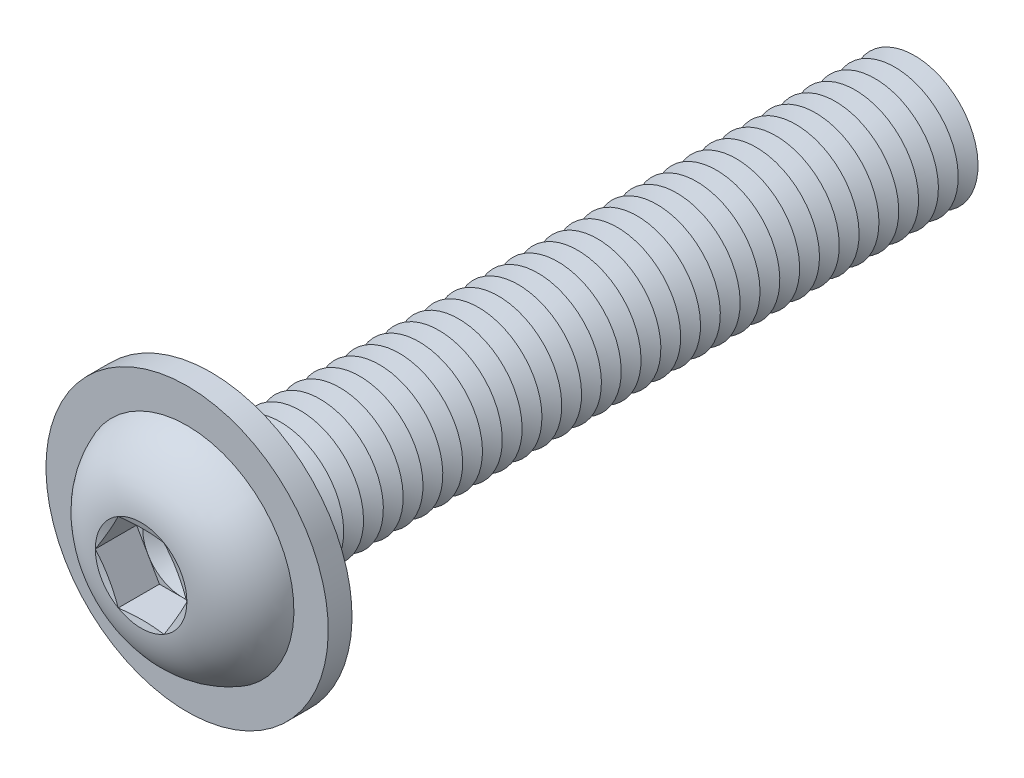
ISO-10303-21;
HEADER;
FILE_DESCRIPTION(('STEP AP214'),'2;1');
FILE_NAME('part.step','',(''),(''),'','','');
FILE_SCHEMA(('AUTOMOTIVE_DESIGN { 1 0 10303 214 1 1 1 1 }'));
ENDSEC;
DATA;
#1=APPLICATION_CONTEXT('core data for automotive mechanical design processes');
#2=APPLICATION_PROTOCOL_DEFINITION('international standard','automotive_design',2000,#1);
#3=PRODUCT_CONTEXT('',#1,'mechanical');
#4=PRODUCT('Part','Part','',(#3));
#5=PRODUCT_RELATED_PRODUCT_CATEGORY('part','',(#4));
#6=PRODUCT_DEFINITION_FORMATION('','',#4);
#7=PRODUCT_DEFINITION_CONTEXT('part definition',#1,'design');
#8=PRODUCT_DEFINITION('design','',#6,#7);
#9=PRODUCT_DEFINITION_SHAPE('','',#8);
#10=(LENGTH_UNIT() NAMED_UNIT(*) SI_UNIT(.MILLI.,.METRE.));
#11=(NAMED_UNIT(*) PLANE_ANGLE_UNIT() SI_UNIT($,.RADIAN.));
#12=(NAMED_UNIT(*) SI_UNIT($,.STERADIAN.) SOLID_ANGLE_UNIT());
#13=UNCERTAINTY_MEASURE_WITH_UNIT(LENGTH_MEASURE(1.E-05),#10,'distance_accuracy_value','');
#14=(GEOMETRIC_REPRESENTATION_CONTEXT(3) GLOBAL_UNCERTAINTY_ASSIGNED_CONTEXT((#13)) GLOBAL_UNIT_ASSIGNED_CONTEXT((#10,
#11,#12)) REPRESENTATION_CONTEXT('',''));
#15=CARTESIAN_POINT('',(0.,0.,0.));
#16=DIRECTION('',(0.,0.,1.));
#17=DIRECTION('',(1.,0.,0.));
#18=AXIS2_PLACEMENT_3D('',#15,#16,#17);
#19=CARTESIAN_POINT('',(0.,0.,-40.625));
#20=DIRECTION('',(0.,0.,1.));
#21=DIRECTION('',(0.,-1.,0.));
#22=AXIS2_PLACEMENT_3D('',#19,#20,#21);
#23=CONICAL_SURFACE('',#22,3.99999999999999,1.0471975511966);
#24=CARTESIAN_POINT('',(0.,0.,-41.25));
#25=DIRECTION('',(0.,0.,1.));
#26=DIRECTION('',(0.,-1.,0.));
#27=AXIS2_PLACEMENT_3D('',#24,#25,#26);
#28=CIRCLE('',#27,2.91746824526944);
#29=CARTESIAN_POINT('',(0.,-2.91746824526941,-41.25));
#30=VERTEX_POINT('',#29);
#31=EDGE_CURVE('E496',#30,#30,#28,.T.);
#32=ORIENTED_EDGE('',*,*,#31,.T.);
#33=EDGE_LOOP('',(#32));
#34=FACE_BOUND('',#33,.T.);
#35=CARTESIAN_POINT('',(0.,0.,-40.625));
#36=DIRECTION('',(0.,0.,1.));
#37=DIRECTION('',(0.,-1.,0.));
#38=AXIS2_PLACEMENT_3D('',#35,#36,#37);
#39=CIRCLE('',#38,3.99999999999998);
#40=CARTESIAN_POINT('',(0.,-3.99999999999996,-40.625));
#41=VERTEX_POINT('',#40);
#42=EDGE_CURVE('E492',#41,#41,#39,.T.);
#43=ORIENTED_EDGE('',*,*,#42,.F.);
#44=EDGE_LOOP('',(#43));
#45=FACE_BOUND('',#44,.T.);
#46=ADVANCED_FACE('F39',(#34,#45),#23,.T.);
#47=CARTESIAN_POINT('',(0.,0.,-41.25));
#48=DIRECTION('',(0.,0.,-1.));
#49=DIRECTION('',(0.,1.,0.));
#50=AXIS2_PLACEMENT_3D('',#47,#48,#49);
#51=CONICAL_SURFACE('',#50,2.91746824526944,1.0471975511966);
#52=CARTESIAN_POINT('',(0.,0.,-41.875));
#53=DIRECTION('',(0.,0.,1.));
#54=DIRECTION('',(0.,-1.,0.));
#55=AXIS2_PLACEMENT_3D('',#52,#53,#54);
#56=CIRCLE('',#55,3.99999999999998);
#57=CARTESIAN_POINT('',(0.,-3.99999999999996,-41.875));
#58=VERTEX_POINT('',#57);
#59=EDGE_CURVE('E500',#58,#58,#56,.T.);
#60=ORIENTED_EDGE('',*,*,#59,.T.);
#61=EDGE_LOOP('',(#60));
#62=FACE_BOUND('',#61,.T.);
#63=ORIENTED_EDGE('',*,*,#31,.F.);
#64=EDGE_LOOP('',(#63));
#65=FACE_BOUND('',#64,.T.);
#66=ADVANCED_FACE('F617',(#62,#65),#51,.T.);
#67=CARTESIAN_POINT('',(0.,3.99999999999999,-45.));
#68=DIRECTION('',(0.,0.,-1.));
#69=DIRECTION('',(0.,1.,0.));
#70=AXIS2_PLACEMENT_3D('',#67,#68,#69);
#71=PLANE('',#70);
#72=CARTESIAN_POINT('',(0.,0.,-45.));
#73=DIRECTION('',(0.,0.,1.));
#74=DIRECTION('',(0.,-1.,0.));
#75=AXIS2_PLACEMENT_3D('',#72,#73,#74);
#76=CIRCLE('',#75,2.91746824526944);
#77=CARTESIAN_POINT('',(0.,-2.91746824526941,-45.));
#78=VERTEX_POINT('',#77);
#79=EDGE_CURVE('E520',#78,#78,#76,.T.);
#80=ORIENTED_EDGE('',*,*,#79,.F.);
#81=EDGE_LOOP('',(#80));
#82=FACE_BOUND('',#81,.T.);
#83=ADVANCED_FACE('F623',(#82),#71,.T.);
#84=CARTESIAN_POINT('',(0.,0.,-44.375));
#85=DIRECTION('',(0.,0.,1.));
#86=DIRECTION('',(0.,-1.,0.));
#87=AXIS2_PLACEMENT_3D('',#84,#85,#86);
#88=CONICAL_SURFACE('',#87,3.99999999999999,1.0471975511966);
#89=ORIENTED_EDGE('',*,*,#79,.T.);
#90=EDGE_LOOP('',(#89));
#91=FACE_BOUND('',#90,.T.);
#92=CARTESIAN_POINT('',(0.,0.,-44.375));
#93=DIRECTION('',(0.,0.,1.));
#94=DIRECTION('',(0.,-1.,0.));
#95=AXIS2_PLACEMENT_3D('',#92,#93,#94);
#96=CIRCLE('',#95,3.99999999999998);
#97=CARTESIAN_POINT('',(0.,-3.99999999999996,-44.375));
#98=VERTEX_POINT('',#97);
#99=EDGE_CURVE('E516',#98,#98,#96,.T.);
#100=ORIENTED_EDGE('',*,*,#99,.F.);
#101=EDGE_LOOP('',(#100));
#102=FACE_BOUND('',#101,.T.);
#103=ADVANCED_FACE('F642',(#91,#102),#88,.T.);
#104=CARTESIAN_POINT('',(0.,0.,-43.75));
#105=DIRECTION('',(0.,0.,-1.));
#106=DIRECTION('',(0.,1.,0.));
#107=AXIS2_PLACEMENT_3D('',#104,#105,#106);
#108=CONICAL_SURFACE('',#107,2.91746824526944,1.0471975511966);
#109=ORIENTED_EDGE('',*,*,#99,.T.);
#110=EDGE_LOOP('',(#109));
#111=FACE_BOUND('',#110,.T.);
#112=CARTESIAN_POINT('',(0.,0.,-43.75));
#113=DIRECTION('',(0.,0.,1.));
#114=DIRECTION('',(0.,-1.,0.));
#115=AXIS2_PLACEMENT_3D('',#112,#113,#114);
#116=CIRCLE('',#115,2.91746824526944);
#117=CARTESIAN_POINT('',(0.,-2.91746824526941,-43.75));
#118=VERTEX_POINT('',#117);
#119=EDGE_CURVE('E512',#118,#118,#116,.T.);
#120=ORIENTED_EDGE('',*,*,#119,.F.);
#121=EDGE_LOOP('',(#120));
#122=FACE_BOUND('',#121,.T.);
#123=ADVANCED_FACE('F639',(#111,#122),#108,.T.);
#124=CARTESIAN_POINT('',(0.,0.,-43.125));
#125=DIRECTION('',(0.,0.,1.));
#126=DIRECTION('',(0.,-1.,0.));
#127=AXIS2_PLACEMENT_3D('',#124,#125,#126);
#128=CONICAL_SURFACE('',#127,3.99999999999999,1.0471975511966);
#129=ORIENTED_EDGE('',*,*,#119,.T.);
#130=EDGE_LOOP('',(#129));
#131=FACE_BOUND('',#130,.T.);
#132=CARTESIAN_POINT('',(0.,0.,-43.125));
#133=DIRECTION('',(0.,0.,1.));
#134=DIRECTION('',(0.,-1.,0.));
#135=AXIS2_PLACEMENT_3D('',#132,#133,#134);
#136=CIRCLE('',#135,3.99999999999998);
#137=CARTESIAN_POINT('',(0.,-3.99999999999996,-43.125));
#138=VERTEX_POINT('',#137);
#139=EDGE_CURVE('E508',#138,#138,#136,.T.);
#140=ORIENTED_EDGE('',*,*,#139,.F.);
#141=EDGE_LOOP('',(#140));
#142=FACE_BOUND('',#141,.T.);
#143=ADVANCED_FACE('F633',(#131,#142),#128,.T.);
#144=CARTESIAN_POINT('',(0.,0.,-42.5));
#145=DIRECTION('',(0.,0.,-1.));
#146=DIRECTION('',(0.,1.,0.));
#147=AXIS2_PLACEMENT_3D('',#144,#145,#146);
#148=CONICAL_SURFACE('',#147,2.91746824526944,1.0471975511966);
#149=ORIENTED_EDGE('',*,*,#139,.T.);
#150=EDGE_LOOP('',(#149));
#151=FACE_BOUND('',#150,.T.);
#152=CARTESIAN_POINT('',(0.,0.,-42.5));
#153=DIRECTION('',(0.,0.,1.));
#154=DIRECTION('',(0.,-1.,0.));
#155=AXIS2_PLACEMENT_3D('',#152,#153,#154);
#156=CIRCLE('',#155,2.91746824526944);
#157=CARTESIAN_POINT('',(0.,-2.91746824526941,-42.5));
#158=VERTEX_POINT('',#157);
#159=EDGE_CURVE('E504',#158,#158,#156,.T.);
#160=ORIENTED_EDGE('',*,*,#159,.F.);
#161=EDGE_LOOP('',(#160));
#162=FACE_BOUND('',#161,.T.);
#163=ADVANCED_FACE('F629',(#151,#162),#148,.T.);
#164=CARTESIAN_POINT('',(0.,0.,-41.875));
#165=DIRECTION('',(0.,0.,1.));
#166=DIRECTION('',(0.,-1.,0.));
#167=AXIS2_PLACEMENT_3D('',#164,#165,#166);
#168=CONICAL_SURFACE('',#167,3.99999999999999,1.0471975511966);
#169=ORIENTED_EDGE('',*,*,#159,.T.);
#170=EDGE_LOOP('',(#169));
#171=FACE_BOUND('',#170,.T.);
#172=ORIENTED_EDGE('',*,*,#59,.F.);
#173=EDGE_LOOP('',(#172));
#174=FACE_BOUND('',#173,.T.);
#175=ADVANCED_FACE('F632',(#171,#174),#168,.T.);
#176=CARTESIAN_POINT('',(0.,0.,-39.375));
#177=DIRECTION('',(0.,0.,1.));
#178=DIRECTION('',(0.,-1.,0.));
#179=AXIS2_PLACEMENT_3D('',#176,#177,#178);
#180=CONICAL_SURFACE('',#179,3.99999999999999,1.0471975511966);
#181=CARTESIAN_POINT('',(0.,0.,-40.));
#182=DIRECTION('',(0.,0.,1.));
#183=DIRECTION('',(0.,-1.,0.));
#184=AXIS2_PLACEMENT_3D('',#181,#182,#183);
#185=CIRCLE('',#184,2.91746824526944);
#186=CARTESIAN_POINT('',(0.,-2.91746824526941,-40.));
#187=VERTEX_POINT('',#186);
#188=EDGE_CURVE('E488',#187,#187,#185,.T.);
#189=ORIENTED_EDGE('',*,*,#188,.T.);
#190=EDGE_LOOP('',(#189));
#191=FACE_BOUND('',#190,.T.);
#192=CARTESIAN_POINT('',(0.,0.,-39.375));
#193=DIRECTION('',(0.,0.,1.));
#194=DIRECTION('',(0.,-1.,0.));
#195=AXIS2_PLACEMENT_3D('',#192,#193,#194);
#196=CIRCLE('',#195,3.99999999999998);
#197=CARTESIAN_POINT('',(0.,-3.99999999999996,-39.375));
#198=VERTEX_POINT('',#197);
#199=EDGE_CURVE('E484',#198,#198,#196,.T.);
#200=ORIENTED_EDGE('',*,*,#199,.F.);
#201=EDGE_LOOP('',(#200));
#202=FACE_BOUND('',#201,.T.);
#203=ADVANCED_FACE('F637',(#191,#202),#180,.T.);
#204=CARTESIAN_POINT('',(0.,0.,-40.));
#205=DIRECTION('',(0.,0.,-1.));
#206=DIRECTION('',(0.,1.,0.));
#207=AXIS2_PLACEMENT_3D('',#204,#205,#206);
#208=CONICAL_SURFACE('',#207,2.91746824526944,1.0471975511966);
#209=ORIENTED_EDGE('',*,*,#42,.T.);
#210=EDGE_LOOP('',(#209));
#211=FACE_BOUND('',#210,.T.);
#212=ORIENTED_EDGE('',*,*,#188,.F.);
#213=EDGE_LOOP('',(#212));
#214=FACE_BOUND('',#213,.T.);
#215=ADVANCED_FACE('F688',(#211,#214),#208,.T.);
#216=CARTESIAN_POINT('',(0.,0.,-38.125));
#217=DIRECTION('',(0.,0.,1.));
#218=DIRECTION('',(0.,-1.,0.));
#219=AXIS2_PLACEMENT_3D('',#216,#217,#218);
#220=CONICAL_SURFACE('',#219,3.99999999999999,1.0471975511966);
#221=CARTESIAN_POINT('',(0.,0.,-38.75));
#222=DIRECTION('',(0.,0.,1.));
#223=DIRECTION('',(0.,-1.,0.));
#224=AXIS2_PLACEMENT_3D('',#221,#222,#223);
#225=CIRCLE('',#224,2.91746824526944);
#226=CARTESIAN_POINT('',(0.,-2.91746824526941,-38.75));
#227=VERTEX_POINT('',#226);
#228=EDGE_CURVE('E481',#227,#227,#225,.T.);
#229=ORIENTED_EDGE('',*,*,#228,.T.);
#230=EDGE_LOOP('',(#229));
#231=FACE_BOUND('',#230,.T.);
#232=CARTESIAN_POINT('',(0.,0.,-38.125));
#233=DIRECTION('',(0.,0.,1.));
#234=DIRECTION('',(0.,-1.,0.));
#235=AXIS2_PLACEMENT_3D('',#232,#233,#234);
#236=CIRCLE('',#235,3.99999999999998);
#237=CARTESIAN_POINT('',(0.,-3.99999999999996,-38.125));
#238=VERTEX_POINT('',#237);
#239=EDGE_CURVE('E477',#238,#238,#236,.T.);
#240=ORIENTED_EDGE('',*,*,#239,.F.);
#241=EDGE_LOOP('',(#240));
#242=FACE_BOUND('',#241,.T.);
#243=ADVANCED_FACE('F694',(#231,#242),#220,.T.);
#244=CARTESIAN_POINT('',(0.,0.,-38.75));
#245=DIRECTION('',(0.,0.,-1.));
#246=DIRECTION('',(0.,1.,0.));
#247=AXIS2_PLACEMENT_3D('',#244,#245,#246);
#248=CONICAL_SURFACE('',#247,2.91746824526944,1.0471975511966);
#249=ORIENTED_EDGE('',*,*,#199,.T.);
#250=EDGE_LOOP('',(#249));
#251=FACE_BOUND('',#250,.T.);
#252=ORIENTED_EDGE('',*,*,#228,.F.);
#253=EDGE_LOOP('',(#252));
#254=FACE_BOUND('',#253,.T.);
#255=ADVANCED_FACE('F701',(#251,#254),#248,.T.);
#256=CARTESIAN_POINT('',(0.,0.,-36.875));
#257=DIRECTION('',(0.,0.,1.));
#258=DIRECTION('',(0.,-1.,0.));
#259=AXIS2_PLACEMENT_3D('',#256,#257,#258);
#260=CONICAL_SURFACE('',#259,3.99999999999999,1.0471975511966);
#261=CARTESIAN_POINT('',(0.,0.,-37.5));
#262=DIRECTION('',(0.,0.,1.));
#263=DIRECTION('',(0.,-1.,0.));
#264=AXIS2_PLACEMENT_3D('',#261,#262,#263);
#265=CIRCLE('',#264,2.91746824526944);
#266=CARTESIAN_POINT('',(0.,-2.91746824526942,-37.5));
#267=VERTEX_POINT('',#266);
#268=EDGE_CURVE('E473',#267,#267,#265,.T.);
#269=ORIENTED_EDGE('',*,*,#268,.T.);
#270=EDGE_LOOP('',(#269));
#271=FACE_BOUND('',#270,.T.);
#272=CARTESIAN_POINT('',(0.,0.,-36.875));
#273=DIRECTION('',(0.,0.,1.));
#274=DIRECTION('',(0.,-1.,0.));
#275=AXIS2_PLACEMENT_3D('',#272,#273,#274);
#276=CIRCLE('',#275,3.99999999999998);
#277=CARTESIAN_POINT('',(0.,-3.99999999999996,-36.875));
#278=VERTEX_POINT('',#277);
#279=EDGE_CURVE('E469',#278,#278,#276,.T.);
#280=ORIENTED_EDGE('',*,*,#279,.F.);
#281=EDGE_LOOP('',(#280));
#282=FACE_BOUND('',#281,.T.);
#283=ADVANCED_FACE('F708',(#271,#282),#260,.T.);
#284=CARTESIAN_POINT('',(0.,0.,-37.5));
#285=DIRECTION('',(0.,0.,-1.));
#286=DIRECTION('',(0.,1.,0.));
#287=AXIS2_PLACEMENT_3D('',#284,#285,#286);
#288=CONICAL_SURFACE('',#287,2.91746824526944,1.0471975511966);
#289=ORIENTED_EDGE('',*,*,#239,.T.);
#290=EDGE_LOOP('',(#289));
#291=FACE_BOUND('',#290,.T.);
#292=ORIENTED_EDGE('',*,*,#268,.F.);
#293=EDGE_LOOP('',(#292));
#294=FACE_BOUND('',#293,.T.);
#295=ADVANCED_FACE('F715',(#291,#294),#288,.T.);
#296=CARTESIAN_POINT('',(0.,0.,-35.625));
#297=DIRECTION('',(0.,0.,1.));
#298=DIRECTION('',(0.,-1.,0.));
#299=AXIS2_PLACEMENT_3D('',#296,#297,#298);
#300=CONICAL_SURFACE('',#299,3.99999999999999,1.0471975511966);
#301=CARTESIAN_POINT('',(0.,0.,-36.25));
#302=DIRECTION('',(0.,0.,1.));
#303=DIRECTION('',(0.,-1.,0.));
#304=AXIS2_PLACEMENT_3D('',#301,#302,#303);
#305=CIRCLE('',#304,2.91746824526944);
#306=CARTESIAN_POINT('',(0.,-2.91746824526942,-36.25));
#307=VERTEX_POINT('',#306);
#308=EDGE_CURVE('E465',#307,#307,#305,.T.);
#309=ORIENTED_EDGE('',*,*,#308,.T.);
#310=EDGE_LOOP('',(#309));
#311=FACE_BOUND('',#310,.T.);
#312=CARTESIAN_POINT('',(0.,0.,-35.625));
#313=DIRECTION('',(0.,0.,1.));
#314=DIRECTION('',(0.,-1.,0.));
#315=AXIS2_PLACEMENT_3D('',#312,#313,#314);
#316=CIRCLE('',#315,3.99999999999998);
#317=CARTESIAN_POINT('',(0.,-3.99999999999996,-35.625));
#318=VERTEX_POINT('',#317);
#319=EDGE_CURVE('E461',#318,#318,#316,.T.);
#320=ORIENTED_EDGE('',*,*,#319,.F.);
#321=EDGE_LOOP('',(#320));
#322=FACE_BOUND('',#321,.T.);
#323=ADVANCED_FACE('F722',(#311,#322),#300,.T.);
#324=CARTESIAN_POINT('',(0.,0.,-36.25));
#325=DIRECTION('',(0.,0.,-1.));
#326=DIRECTION('',(0.,1.,0.));
#327=AXIS2_PLACEMENT_3D('',#324,#325,#326);
#328=CONICAL_SURFACE('',#327,2.91746824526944,1.0471975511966);
#329=ORIENTED_EDGE('',*,*,#279,.T.);
#330=EDGE_LOOP('',(#329));
#331=FACE_BOUND('',#330,.T.);
#332=ORIENTED_EDGE('',*,*,#308,.F.);
#333=EDGE_LOOP('',(#332));
#334=FACE_BOUND('',#333,.T.);
#335=ADVANCED_FACE('F729',(#331,#334),#328,.T.);
#336=CARTESIAN_POINT('',(0.,0.,-34.375));
#337=DIRECTION('',(0.,0.,1.));
#338=DIRECTION('',(0.,-1.,0.));
#339=AXIS2_PLACEMENT_3D('',#336,#337,#338);
#340=CONICAL_SURFACE('',#339,3.99999999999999,1.0471975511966);
#341=CARTESIAN_POINT('',(0.,0.,-35.));
#342=DIRECTION('',(0.,0.,1.));
#343=DIRECTION('',(0.,-1.,0.));
#344=AXIS2_PLACEMENT_3D('',#341,#342,#343);
#345=CIRCLE('',#344,2.91746824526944);
#346=CARTESIAN_POINT('',(0.,-2.91746824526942,-35.));
#347=VERTEX_POINT('',#346);
#348=EDGE_CURVE('E457',#347,#347,#345,.T.);
#349=ORIENTED_EDGE('',*,*,#348,.T.);
#350=EDGE_LOOP('',(#349));
#351=FACE_BOUND('',#350,.T.);
#352=CARTESIAN_POINT('',(0.,0.,-34.375));
#353=DIRECTION('',(0.,0.,1.));
#354=DIRECTION('',(0.,-1.,0.));
#355=AXIS2_PLACEMENT_3D('',#352,#353,#354);
#356=CIRCLE('',#355,3.99999999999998);
#357=CARTESIAN_POINT('',(0.,-3.99999999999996,-34.375));
#358=VERTEX_POINT('',#357);
#359=EDGE_CURVE('E453',#358,#358,#356,.T.);
#360=ORIENTED_EDGE('',*,*,#359,.F.);
#361=EDGE_LOOP('',(#360));
#362=FACE_BOUND('',#361,.T.);
#363=ADVANCED_FACE('F736',(#351,#362),#340,.T.);
#364=CARTESIAN_POINT('',(0.,0.,-35.));
#365=DIRECTION('',(0.,0.,-1.));
#366=DIRECTION('',(0.,1.,0.));
#367=AXIS2_PLACEMENT_3D('',#364,#365,#366);
#368=CONICAL_SURFACE('',#367,2.91746824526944,1.0471975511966);
#369=ORIENTED_EDGE('',*,*,#319,.T.);
#370=EDGE_LOOP('',(#369));
#371=FACE_BOUND('',#370,.T.);
#372=ORIENTED_EDGE('',*,*,#348,.F.);
#373=EDGE_LOOP('',(#372));
#374=FACE_BOUND('',#373,.T.);
#375=ADVANCED_FACE('F743',(#371,#374),#368,.T.);
#376=CARTESIAN_POINT('',(0.,0.,-33.125));
#377=DIRECTION('',(0.,0.,1.));
#378=DIRECTION('',(0.,-1.,0.));
#379=AXIS2_PLACEMENT_3D('',#376,#377,#378);
#380=CONICAL_SURFACE('',#379,3.99999999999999,1.0471975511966);
#381=CARTESIAN_POINT('',(0.,0.,-33.75));
#382=DIRECTION('',(0.,0.,1.));
#383=DIRECTION('',(0.,-1.,0.));
#384=AXIS2_PLACEMENT_3D('',#381,#382,#383);
#385=CIRCLE('',#384,2.91746824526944);
#386=CARTESIAN_POINT('',(0.,-2.91746824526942,-33.75));
#387=VERTEX_POINT('',#386);
#388=EDGE_CURVE('E449',#387,#387,#385,.T.);
#389=ORIENTED_EDGE('',*,*,#388,.T.);
#390=EDGE_LOOP('',(#389));
#391=FACE_BOUND('',#390,.T.);
#392=CARTESIAN_POINT('',(0.,0.,-33.125));
#393=DIRECTION('',(0.,0.,1.));
#394=DIRECTION('',(0.,-1.,0.));
#395=AXIS2_PLACEMENT_3D('',#392,#393,#394);
#396=CIRCLE('',#395,3.99999999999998);
#397=CARTESIAN_POINT('',(0.,-3.99999999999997,-33.125));
#398=VERTEX_POINT('',#397);
#399=EDGE_CURVE('E445',#398,#398,#396,.T.);
#400=ORIENTED_EDGE('',*,*,#399,.F.);
#401=EDGE_LOOP('',(#400));
#402=FACE_BOUND('',#401,.T.);
#403=ADVANCED_FACE('F750',(#391,#402),#380,.T.);
#404=CARTESIAN_POINT('',(0.,0.,-33.75));
#405=DIRECTION('',(0.,0.,-1.));
#406=DIRECTION('',(0.,1.,0.));
#407=AXIS2_PLACEMENT_3D('',#404,#405,#406);
#408=CONICAL_SURFACE('',#407,2.91746824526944,1.0471975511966);
#409=ORIENTED_EDGE('',*,*,#359,.T.);
#410=EDGE_LOOP('',(#409));
#411=FACE_BOUND('',#410,.T.);
#412=ORIENTED_EDGE('',*,*,#388,.F.);
#413=EDGE_LOOP('',(#412));
#414=FACE_BOUND('',#413,.T.);
#415=ADVANCED_FACE('F757',(#411,#414),#408,.T.);
#416=CARTESIAN_POINT('',(0.,0.,-31.875));
#417=DIRECTION('',(0.,0.,1.));
#418=DIRECTION('',(0.,-1.,0.));
#419=AXIS2_PLACEMENT_3D('',#416,#417,#418);
#420=CONICAL_SURFACE('',#419,3.99999999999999,1.0471975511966);
#421=CARTESIAN_POINT('',(0.,0.,-32.5));
#422=DIRECTION('',(0.,0.,1.));
#423=DIRECTION('',(0.,-1.,0.));
#424=AXIS2_PLACEMENT_3D('',#421,#422,#423);
#425=CIRCLE('',#424,2.91746824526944);
#426=CARTESIAN_POINT('',(0.,-2.91746824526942,-32.5));
#427=VERTEX_POINT('',#426);
#428=EDGE_CURVE('E441',#427,#427,#425,.T.);
#429=ORIENTED_EDGE('',*,*,#428,.T.);
#430=EDGE_LOOP('',(#429));
#431=FACE_BOUND('',#430,.T.);
#432=CARTESIAN_POINT('',(0.,0.,-31.875));
#433=DIRECTION('',(0.,0.,1.));
#434=DIRECTION('',(0.,-1.,0.));
#435=AXIS2_PLACEMENT_3D('',#432,#433,#434);
#436=CIRCLE('',#435,3.99999999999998);
#437=CARTESIAN_POINT('',(0.,-3.99999999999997,-31.875));
#438=VERTEX_POINT('',#437);
#439=EDGE_CURVE('E437',#438,#438,#436,.T.);
#440=ORIENTED_EDGE('',*,*,#439,.F.);
#441=EDGE_LOOP('',(#440));
#442=FACE_BOUND('',#441,.T.);
#443=ADVANCED_FACE('F764',(#431,#442),#420,.T.);
#444=CARTESIAN_POINT('',(0.,0.,-32.5));
#445=DIRECTION('',(0.,0.,-1.));
#446=DIRECTION('',(0.,1.,0.));
#447=AXIS2_PLACEMENT_3D('',#444,#445,#446);
#448=CONICAL_SURFACE('',#447,2.91746824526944,1.0471975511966);
#449=ORIENTED_EDGE('',*,*,#399,.T.);
#450=EDGE_LOOP('',(#449));
#451=FACE_BOUND('',#450,.T.);
#452=ORIENTED_EDGE('',*,*,#428,.F.);
#453=EDGE_LOOP('',(#452));
#454=FACE_BOUND('',#453,.T.);
#455=ADVANCED_FACE('F771',(#451,#454),#448,.T.);
#456=CARTESIAN_POINT('',(0.,0.,-30.625));
#457=DIRECTION('',(0.,0.,1.));
#458=DIRECTION('',(0.,-1.,0.));
#459=AXIS2_PLACEMENT_3D('',#456,#457,#458);
#460=CONICAL_SURFACE('',#459,3.99999999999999,1.0471975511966);
#461=CARTESIAN_POINT('',(0.,0.,-31.25));
#462=DIRECTION('',(0.,0.,1.));
#463=DIRECTION('',(0.,-1.,0.));
#464=AXIS2_PLACEMENT_3D('',#461,#462,#463);
#465=CIRCLE('',#464,2.91746824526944);
#466=CARTESIAN_POINT('',(0.,-2.91746824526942,-31.25));
#467=VERTEX_POINT('',#466);
#468=EDGE_CURVE('E433',#467,#467,#465,.T.);
#469=ORIENTED_EDGE('',*,*,#468,.T.);
#470=EDGE_LOOP('',(#469));
#471=FACE_BOUND('',#470,.T.);
#472=CARTESIAN_POINT('',(0.,0.,-30.625));
#473=DIRECTION('',(0.,0.,1.));
#474=DIRECTION('',(0.,-1.,0.));
#475=AXIS2_PLACEMENT_3D('',#472,#473,#474);
#476=CIRCLE('',#475,3.99999999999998);
#477=CARTESIAN_POINT('',(0.,-3.99999999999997,-30.625));
#478=VERTEX_POINT('',#477);
#479=EDGE_CURVE('E429',#478,#478,#476,.T.);
#480=ORIENTED_EDGE('',*,*,#479,.F.);
#481=EDGE_LOOP('',(#480));
#482=FACE_BOUND('',#481,.T.);
#483=ADVANCED_FACE('F778',(#471,#482),#460,.T.);
#484=CARTESIAN_POINT('',(0.,0.,-31.25));
#485=DIRECTION('',(0.,0.,-1.));
#486=DIRECTION('',(0.,1.,0.));
#487=AXIS2_PLACEMENT_3D('',#484,#485,#486);
#488=CONICAL_SURFACE('',#487,2.91746824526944,1.0471975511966);
#489=ORIENTED_EDGE('',*,*,#439,.T.);
#490=EDGE_LOOP('',(#489));
#491=FACE_BOUND('',#490,.T.);
#492=ORIENTED_EDGE('',*,*,#468,.F.);
#493=EDGE_LOOP('',(#492));
#494=FACE_BOUND('',#493,.T.);
#495=ADVANCED_FACE('F785',(#491,#494),#488,.T.);
#496=CARTESIAN_POINT('',(0.,0.,-29.375));
#497=DIRECTION('',(0.,0.,1.));
#498=DIRECTION('',(0.,-1.,0.));
#499=AXIS2_PLACEMENT_3D('',#496,#497,#498);
#500=CONICAL_SURFACE('',#499,3.99999999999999,1.0471975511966);
#501=CARTESIAN_POINT('',(0.,0.,-30.));
#502=DIRECTION('',(0.,0.,1.));
#503=DIRECTION('',(0.,-1.,0.));
#504=AXIS2_PLACEMENT_3D('',#501,#502,#503);
#505=CIRCLE('',#504,2.91746824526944);
#506=CARTESIAN_POINT('',(0.,-2.91746824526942,-30.));
#507=VERTEX_POINT('',#506);
#508=EDGE_CURVE('E425',#507,#507,#505,.T.);
#509=ORIENTED_EDGE('',*,*,#508,.T.);
#510=EDGE_LOOP('',(#509));
#511=FACE_BOUND('',#510,.T.);
#512=CARTESIAN_POINT('',(0.,0.,-29.375));
#513=DIRECTION('',(0.,0.,1.));
#514=DIRECTION('',(0.,-1.,0.));
#515=AXIS2_PLACEMENT_3D('',#512,#513,#514);
#516=CIRCLE('',#515,3.99999999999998);
#517=CARTESIAN_POINT('',(0.,-3.99999999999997,-29.375));
#518=VERTEX_POINT('',#517);
#519=EDGE_CURVE('E421',#518,#518,#516,.T.);
#520=ORIENTED_EDGE('',*,*,#519,.F.);
#521=EDGE_LOOP('',(#520));
#522=FACE_BOUND('',#521,.T.);
#523=ADVANCED_FACE('F792',(#511,#522),#500,.T.);
#524=CARTESIAN_POINT('',(0.,0.,-30.));
#525=DIRECTION('',(0.,0.,-1.));
#526=DIRECTION('',(0.,1.,0.));
#527=AXIS2_PLACEMENT_3D('',#524,#525,#526);
#528=CONICAL_SURFACE('',#527,2.91746824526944,1.0471975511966);
#529=ORIENTED_EDGE('',*,*,#479,.T.);
#530=EDGE_LOOP('',(#529));
#531=FACE_BOUND('',#530,.T.);
#532=ORIENTED_EDGE('',*,*,#508,.F.);
#533=EDGE_LOOP('',(#532));
#534=FACE_BOUND('',#533,.T.);
#535=ADVANCED_FACE('F799',(#531,#534),#528,.T.);
#536=CARTESIAN_POINT('',(0.,0.,-28.125));
#537=DIRECTION('',(0.,0.,1.));
#538=DIRECTION('',(0.,-1.,0.));
#539=AXIS2_PLACEMENT_3D('',#536,#537,#538);
#540=CONICAL_SURFACE('',#539,3.99999999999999,1.0471975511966);
#541=CARTESIAN_POINT('',(0.,0.,-28.75));
#542=DIRECTION('',(0.,0.,1.));
#543=DIRECTION('',(0.,-1.,0.));
#544=AXIS2_PLACEMENT_3D('',#541,#542,#543);
#545=CIRCLE('',#544,2.91746824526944);
#546=CARTESIAN_POINT('',(0.,-2.91746824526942,-28.75));
#547=VERTEX_POINT('',#546);
#548=EDGE_CURVE('E417',#547,#547,#545,.T.);
#549=ORIENTED_EDGE('',*,*,#548,.T.);
#550=EDGE_LOOP('',(#549));
#551=FACE_BOUND('',#550,.T.);
#552=CARTESIAN_POINT('',(0.,0.,-28.125));
#553=DIRECTION('',(0.,0.,1.));
#554=DIRECTION('',(0.,-1.,0.));
#555=AXIS2_PLACEMENT_3D('',#552,#553,#554);
#556=CIRCLE('',#555,3.99999999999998);
#557=CARTESIAN_POINT('',(0.,-3.99999999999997,-28.125));
#558=VERTEX_POINT('',#557);
#559=EDGE_CURVE('E413',#558,#558,#556,.T.);
#560=ORIENTED_EDGE('',*,*,#559,.F.);
#561=EDGE_LOOP('',(#560));
#562=FACE_BOUND('',#561,.T.);
#563=ADVANCED_FACE('F806',(#551,#562),#540,.T.);
#564=CARTESIAN_POINT('',(0.,0.,-28.75));
#565=DIRECTION('',(0.,0.,-1.));
#566=DIRECTION('',(0.,1.,0.));
#567=AXIS2_PLACEMENT_3D('',#564,#565,#566);
#568=CONICAL_SURFACE('',#567,2.91746824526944,1.0471975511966);
#569=ORIENTED_EDGE('',*,*,#519,.T.);
#570=EDGE_LOOP('',(#569));
#571=FACE_BOUND('',#570,.T.);
#572=ORIENTED_EDGE('',*,*,#548,.F.);
#573=EDGE_LOOP('',(#572));
#574=FACE_BOUND('',#573,.T.);
#575=ADVANCED_FACE('F813',(#571,#574),#568,.T.);
#576=CARTESIAN_POINT('',(0.,0.,-26.875));
#577=DIRECTION('',(0.,0.,1.));
#578=DIRECTION('',(0.,-1.,0.));
#579=AXIS2_PLACEMENT_3D('',#576,#577,#578);
#580=CONICAL_SURFACE('',#579,3.99999999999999,1.0471975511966);
#581=CARTESIAN_POINT('',(0.,0.,-27.5));
#582=DIRECTION('',(0.,0.,1.));
#583=DIRECTION('',(0.,-1.,0.));
#584=AXIS2_PLACEMENT_3D('',#581,#582,#583);
#585=CIRCLE('',#584,2.91746824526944);
#586=CARTESIAN_POINT('',(0.,-2.91746824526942,-27.5));
#587=VERTEX_POINT('',#586);
#588=EDGE_CURVE('E409',#587,#587,#585,.T.);
#589=ORIENTED_EDGE('',*,*,#588,.T.);
#590=EDGE_LOOP('',(#589));
#591=FACE_BOUND('',#590,.T.);
#592=CARTESIAN_POINT('',(0.,0.,-26.875));
#593=DIRECTION('',(0.,0.,1.));
#594=DIRECTION('',(0.,-1.,0.));
#595=AXIS2_PLACEMENT_3D('',#592,#593,#594);
#596=CIRCLE('',#595,3.99999999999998);
#597=CARTESIAN_POINT('',(0.,-3.99999999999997,-26.875));
#598=VERTEX_POINT('',#597);
#599=EDGE_CURVE('E405',#598,#598,#596,.T.);
#600=ORIENTED_EDGE('',*,*,#599,.F.);
#601=EDGE_LOOP('',(#600));
#602=FACE_BOUND('',#601,.T.);
#603=ADVANCED_FACE('F820',(#591,#602),#580,.T.);
#604=CARTESIAN_POINT('',(0.,0.,-27.5));
#605=DIRECTION('',(0.,0.,-1.));
#606=DIRECTION('',(0.,1.,0.));
#607=AXIS2_PLACEMENT_3D('',#604,#605,#606);
#608=CONICAL_SURFACE('',#607,2.91746824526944,1.0471975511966);
#609=ORIENTED_EDGE('',*,*,#559,.T.);
#610=EDGE_LOOP('',(#609));
#611=FACE_BOUND('',#610,.T.);
#612=ORIENTED_EDGE('',*,*,#588,.F.);
#613=EDGE_LOOP('',(#612));
#614=FACE_BOUND('',#613,.T.);
#615=ADVANCED_FACE('F827',(#611,#614),#608,.T.);
#616=CARTESIAN_POINT('',(0.,0.,-25.625));
#617=DIRECTION('',(0.,0.,1.));
#618=DIRECTION('',(0.,-1.,0.));
#619=AXIS2_PLACEMENT_3D('',#616,#617,#618);
#620=CONICAL_SURFACE('',#619,3.99999999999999,1.0471975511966);
#621=CARTESIAN_POINT('',(0.,0.,-26.25));
#622=DIRECTION('',(0.,0.,1.));
#623=DIRECTION('',(0.,-1.,0.));
#624=AXIS2_PLACEMENT_3D('',#621,#622,#623);
#625=CIRCLE('',#624,2.91746824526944);
#626=CARTESIAN_POINT('',(0.,-2.91746824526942,-26.25));
#627=VERTEX_POINT('',#626);
#628=EDGE_CURVE('E401',#627,#627,#625,.T.);
#629=ORIENTED_EDGE('',*,*,#628,.T.);
#630=EDGE_LOOP('',(#629));
#631=FACE_BOUND('',#630,.T.);
#632=CARTESIAN_POINT('',(0.,0.,-25.625));
#633=DIRECTION('',(0.,0.,1.));
#634=DIRECTION('',(0.,-1.,0.));
#635=AXIS2_PLACEMENT_3D('',#632,#633,#634);
#636=CIRCLE('',#635,3.99999999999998);
#637=CARTESIAN_POINT('',(0.,-3.99999999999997,-25.625));
#638=VERTEX_POINT('',#637);
#639=EDGE_CURVE('E397',#638,#638,#636,.T.);
#640=ORIENTED_EDGE('',*,*,#639,.F.);
#641=EDGE_LOOP('',(#640));
#642=FACE_BOUND('',#641,.T.);
#643=ADVANCED_FACE('F834',(#631,#642),#620,.T.);
#644=CARTESIAN_POINT('',(0.,0.,-26.25));
#645=DIRECTION('',(0.,0.,-1.));
#646=DIRECTION('',(0.,1.,0.));
#647=AXIS2_PLACEMENT_3D('',#644,#645,#646);
#648=CONICAL_SURFACE('',#647,2.91746824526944,1.0471975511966);
#649=ORIENTED_EDGE('',*,*,#599,.T.);
#650=EDGE_LOOP('',(#649));
#651=FACE_BOUND('',#650,.T.);
#652=ORIENTED_EDGE('',*,*,#628,.F.);
#653=EDGE_LOOP('',(#652));
#654=FACE_BOUND('',#653,.T.);
#655=ADVANCED_FACE('F841',(#651,#654),#648,.T.);
#656=CARTESIAN_POINT('',(0.,0.,-24.375));
#657=DIRECTION('',(0.,0.,1.));
#658=DIRECTION('',(0.,-1.,0.));
#659=AXIS2_PLACEMENT_3D('',#656,#657,#658);
#660=CONICAL_SURFACE('',#659,3.99999999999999,1.0471975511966);
#661=CARTESIAN_POINT('',(0.,0.,-25.));
#662=DIRECTION('',(0.,0.,1.));
#663=DIRECTION('',(0.,-1.,0.));
#664=AXIS2_PLACEMENT_3D('',#661,#662,#663);
#665=CIRCLE('',#664,2.91746824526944);
#666=CARTESIAN_POINT('',(0.,-2.91746824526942,-25.));
#667=VERTEX_POINT('',#666);
#668=EDGE_CURVE('E393',#667,#667,#665,.T.);
#669=ORIENTED_EDGE('',*,*,#668,.T.);
#670=EDGE_LOOP('',(#669));
#671=FACE_BOUND('',#670,.T.);
#672=CARTESIAN_POINT('',(0.,0.,-24.375));
#673=DIRECTION('',(0.,0.,1.));
#674=DIRECTION('',(0.,-1.,0.));
#675=AXIS2_PLACEMENT_3D('',#672,#673,#674);
#676=CIRCLE('',#675,3.99999999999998);
#677=CARTESIAN_POINT('',(0.,-3.99999999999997,-24.375));
#678=VERTEX_POINT('',#677);
#679=EDGE_CURVE('E389',#678,#678,#676,.T.);
#680=ORIENTED_EDGE('',*,*,#679,.F.);
#681=EDGE_LOOP('',(#680));
#682=FACE_BOUND('',#681,.T.);
#683=ADVANCED_FACE('F848',(#671,#682),#660,.T.);
#684=CARTESIAN_POINT('',(0.,0.,-25.));
#685=DIRECTION('',(0.,0.,-1.));
#686=DIRECTION('',(0.,1.,0.));
#687=AXIS2_PLACEMENT_3D('',#684,#685,#686);
#688=CONICAL_SURFACE('',#687,2.91746824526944,1.0471975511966);
#689=ORIENTED_EDGE('',*,*,#639,.T.);
#690=EDGE_LOOP('',(#689));
#691=FACE_BOUND('',#690,.T.);
#692=ORIENTED_EDGE('',*,*,#668,.F.);
#693=EDGE_LOOP('',(#692));
#694=FACE_BOUND('',#693,.T.);
#695=ADVANCED_FACE('F855',(#691,#694),#688,.T.);
#696=CARTESIAN_POINT('',(0.,0.,-23.125));
#697=DIRECTION('',(0.,0.,1.));
#698=DIRECTION('',(0.,-1.,0.));
#699=AXIS2_PLACEMENT_3D('',#696,#697,#698);
#700=CONICAL_SURFACE('',#699,3.99999999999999,1.0471975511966);
#701=CARTESIAN_POINT('',(0.,0.,-23.75));
#702=DIRECTION('',(0.,0.,1.));
#703=DIRECTION('',(0.,-1.,0.));
#704=AXIS2_PLACEMENT_3D('',#701,#702,#703);
#705=CIRCLE('',#704,2.91746824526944);
#706=CARTESIAN_POINT('',(0.,-2.91746824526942,-23.75));
#707=VERTEX_POINT('',#706);
#708=EDGE_CURVE('E385',#707,#707,#705,.T.);
#709=ORIENTED_EDGE('',*,*,#708,.T.);
#710=EDGE_LOOP('',(#709));
#711=FACE_BOUND('',#710,.T.);
#712=CARTESIAN_POINT('',(0.,0.,-23.125));
#713=DIRECTION('',(0.,0.,1.));
#714=DIRECTION('',(0.,-1.,0.));
#715=AXIS2_PLACEMENT_3D('',#712,#713,#714);
#716=CIRCLE('',#715,3.99999999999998);
#717=CARTESIAN_POINT('',(0.,-3.99999999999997,-23.125));
#718=VERTEX_POINT('',#717);
#719=EDGE_CURVE('E381',#718,#718,#716,.T.);
#720=ORIENTED_EDGE('',*,*,#719,.F.);
#721=EDGE_LOOP('',(#720));
#722=FACE_BOUND('',#721,.T.);
#723=ADVANCED_FACE('F862',(#711,#722),#700,.T.);
#724=CARTESIAN_POINT('',(0.,0.,-23.75));
#725=DIRECTION('',(0.,0.,-1.));
#726=DIRECTION('',(0.,1.,0.));
#727=AXIS2_PLACEMENT_3D('',#724,#725,#726);
#728=CONICAL_SURFACE('',#727,2.91746824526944,1.0471975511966);
#729=ORIENTED_EDGE('',*,*,#679,.T.);
#730=EDGE_LOOP('',(#729));
#731=FACE_BOUND('',#730,.T.);
#732=ORIENTED_EDGE('',*,*,#708,.F.);
#733=EDGE_LOOP('',(#732));
#734=FACE_BOUND('',#733,.T.);
#735=ADVANCED_FACE('F869',(#731,#734),#728,.T.);
#736=CARTESIAN_POINT('',(0.,0.,-21.875));
#737=DIRECTION('',(0.,0.,1.));
#738=DIRECTION('',(0.,-1.,0.));
#739=AXIS2_PLACEMENT_3D('',#736,#737,#738);
#740=CONICAL_SURFACE('',#739,3.99999999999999,1.0471975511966);
#741=CARTESIAN_POINT('',(0.,0.,-22.5));
#742=DIRECTION('',(0.,0.,1.));
#743=DIRECTION('',(0.,-1.,0.));
#744=AXIS2_PLACEMENT_3D('',#741,#742,#743);
#745=CIRCLE('',#744,2.91746824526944);
#746=CARTESIAN_POINT('',(0.,-2.91746824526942,-22.5));
#747=VERTEX_POINT('',#746);
#748=EDGE_CURVE('E377',#747,#747,#745,.T.);
#749=ORIENTED_EDGE('',*,*,#748,.T.);
#750=EDGE_LOOP('',(#749));
#751=FACE_BOUND('',#750,.T.);
#752=CARTESIAN_POINT('',(0.,0.,-21.875));
#753=DIRECTION('',(0.,0.,1.));
#754=DIRECTION('',(0.,-1.,0.));
#755=AXIS2_PLACEMENT_3D('',#752,#753,#754);
#756=CIRCLE('',#755,3.99999999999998);
#757=CARTESIAN_POINT('',(0.,-3.99999999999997,-21.875));
#758=VERTEX_POINT('',#757);
#759=EDGE_CURVE('E373',#758,#758,#756,.T.);
#760=ORIENTED_EDGE('',*,*,#759,.F.);
#761=EDGE_LOOP('',(#760));
#762=FACE_BOUND('',#761,.T.);
#763=ADVANCED_FACE('F876',(#751,#762),#740,.T.);
#764=CARTESIAN_POINT('',(0.,0.,-22.5));
#765=DIRECTION('',(0.,0.,-1.));
#766=DIRECTION('',(0.,1.,0.));
#767=AXIS2_PLACEMENT_3D('',#764,#765,#766);
#768=CONICAL_SURFACE('',#767,2.91746824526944,1.0471975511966);
#769=ORIENTED_EDGE('',*,*,#719,.T.);
#770=EDGE_LOOP('',(#769));
#771=FACE_BOUND('',#770,.T.);
#772=ORIENTED_EDGE('',*,*,#748,.F.);
#773=EDGE_LOOP('',(#772));
#774=FACE_BOUND('',#773,.T.);
#775=ADVANCED_FACE('F883',(#771,#774),#768,.T.);
#776=CARTESIAN_POINT('',(0.,0.,-20.625));
#777=DIRECTION('',(0.,0.,1.));
#778=DIRECTION('',(0.,-1.,0.));
#779=AXIS2_PLACEMENT_3D('',#776,#777,#778);
#780=CONICAL_SURFACE('',#779,3.99999999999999,1.0471975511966);
#781=CARTESIAN_POINT('',(0.,0.,-21.25));
#782=DIRECTION('',(0.,0.,1.));
#783=DIRECTION('',(0.,-1.,0.));
#784=AXIS2_PLACEMENT_3D('',#781,#782,#783);
#785=CIRCLE('',#784,2.91746824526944);
#786=CARTESIAN_POINT('',(0.,-2.91746824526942,-21.25));
#787=VERTEX_POINT('',#786);
#788=EDGE_CURVE('E369',#787,#787,#785,.T.);
#789=ORIENTED_EDGE('',*,*,#788,.T.);
#790=EDGE_LOOP('',(#789));
#791=FACE_BOUND('',#790,.T.);
#792=CARTESIAN_POINT('',(0.,0.,-20.625));
#793=DIRECTION('',(0.,0.,1.));
#794=DIRECTION('',(0.,-1.,0.));
#795=AXIS2_PLACEMENT_3D('',#792,#793,#794);
#796=CIRCLE('',#795,3.99999999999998);
#797=CARTESIAN_POINT('',(0.,-3.99999999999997,-20.625));
#798=VERTEX_POINT('',#797);
#799=EDGE_CURVE('E365',#798,#798,#796,.T.);
#800=ORIENTED_EDGE('',*,*,#799,.F.);
#801=EDGE_LOOP('',(#800));
#802=FACE_BOUND('',#801,.T.);
#803=ADVANCED_FACE('F890',(#791,#802),#780,.T.);
#804=CARTESIAN_POINT('',(0.,0.,-21.25));
#805=DIRECTION('',(0.,0.,-1.));
#806=DIRECTION('',(0.,1.,0.));
#807=AXIS2_PLACEMENT_3D('',#804,#805,#806);
#808=CONICAL_SURFACE('',#807,2.91746824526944,1.0471975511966);
#809=ORIENTED_EDGE('',*,*,#759,.T.);
#810=EDGE_LOOP('',(#809));
#811=FACE_BOUND('',#810,.T.);
#812=ORIENTED_EDGE('',*,*,#788,.F.);
#813=EDGE_LOOP('',(#812));
#814=FACE_BOUND('',#813,.T.);
#815=ADVANCED_FACE('F897',(#811,#814),#808,.T.);
#816=CARTESIAN_POINT('',(0.,0.,-19.375));
#817=DIRECTION('',(0.,0.,1.));
#818=DIRECTION('',(0.,-1.,0.));
#819=AXIS2_PLACEMENT_3D('',#816,#817,#818);
#820=CONICAL_SURFACE('',#819,3.99999999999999,1.0471975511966);
#821=CARTESIAN_POINT('',(0.,0.,-20.));
#822=DIRECTION('',(0.,0.,1.));
#823=DIRECTION('',(0.,-1.,0.));
#824=AXIS2_PLACEMENT_3D('',#821,#822,#823);
#825=CIRCLE('',#824,2.91746824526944);
#826=CARTESIAN_POINT('',(0.,-2.91746824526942,-20.));
#827=VERTEX_POINT('',#826);
#828=EDGE_CURVE('E361',#827,#827,#825,.T.);
#829=ORIENTED_EDGE('',*,*,#828,.T.);
#830=EDGE_LOOP('',(#829));
#831=FACE_BOUND('',#830,.T.);
#832=CARTESIAN_POINT('',(0.,0.,-19.375));
#833=DIRECTION('',(0.,0.,1.));
#834=DIRECTION('',(0.,-1.,0.));
#835=AXIS2_PLACEMENT_3D('',#832,#833,#834);
#836=CIRCLE('',#835,3.99999999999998);
#837=CARTESIAN_POINT('',(0.,-3.99999999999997,-19.375));
#838=VERTEX_POINT('',#837);
#839=EDGE_CURVE('E357',#838,#838,#836,.T.);
#840=ORIENTED_EDGE('',*,*,#839,.F.);
#841=EDGE_LOOP('',(#840));
#842=FACE_BOUND('',#841,.T.);
#843=ADVANCED_FACE('F904',(#831,#842),#820,.T.);
#844=CARTESIAN_POINT('',(0.,0.,-20.));
#845=DIRECTION('',(0.,0.,-1.));
#846=DIRECTION('',(0.,1.,0.));
#847=AXIS2_PLACEMENT_3D('',#844,#845,#846);
#848=CONICAL_SURFACE('',#847,2.91746824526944,1.0471975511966);
#849=ORIENTED_EDGE('',*,*,#799,.T.);
#850=EDGE_LOOP('',(#849));
#851=FACE_BOUND('',#850,.T.);
#852=ORIENTED_EDGE('',*,*,#828,.F.);
#853=EDGE_LOOP('',(#852));
#854=FACE_BOUND('',#853,.T.);
#855=ADVANCED_FACE('F911',(#851,#854),#848,.T.);
#856=CARTESIAN_POINT('',(0.,0.,-18.125));
#857=DIRECTION('',(0.,0.,1.));
#858=DIRECTION('',(0.,-1.,0.));
#859=AXIS2_PLACEMENT_3D('',#856,#857,#858);
#860=CONICAL_SURFACE('',#859,3.99999999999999,1.0471975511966);
#861=CARTESIAN_POINT('',(0.,0.,-18.75));
#862=DIRECTION('',(0.,0.,1.));
#863=DIRECTION('',(0.,-1.,0.));
#864=AXIS2_PLACEMENT_3D('',#861,#862,#863);
#865=CIRCLE('',#864,2.91746824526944);
#866=CARTESIAN_POINT('',(0.,-2.91746824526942,-18.75));
#867=VERTEX_POINT('',#866);
#868=EDGE_CURVE('E353',#867,#867,#865,.T.);
#869=ORIENTED_EDGE('',*,*,#868,.T.);
#870=EDGE_LOOP('',(#869));
#871=FACE_BOUND('',#870,.T.);
#872=CARTESIAN_POINT('',(0.,0.,-18.125));
#873=DIRECTION('',(0.,0.,1.));
#874=DIRECTION('',(0.,-1.,0.));
#875=AXIS2_PLACEMENT_3D('',#872,#873,#874);
#876=CIRCLE('',#875,3.99999999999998);
#877=CARTESIAN_POINT('',(0.,-3.99999999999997,-18.125));
#878=VERTEX_POINT('',#877);
#879=EDGE_CURVE('E349',#878,#878,#876,.T.);
#880=ORIENTED_EDGE('',*,*,#879,.F.);
#881=EDGE_LOOP('',(#880));
#882=FACE_BOUND('',#881,.T.);
#883=ADVANCED_FACE('F918',(#871,#882),#860,.T.);
#884=CARTESIAN_POINT('',(0.,0.,-18.75));
#885=DIRECTION('',(0.,0.,-1.));
#886=DIRECTION('',(0.,1.,0.));
#887=AXIS2_PLACEMENT_3D('',#884,#885,#886);
#888=CONICAL_SURFACE('',#887,2.91746824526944,1.0471975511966);
#889=ORIENTED_EDGE('',*,*,#839,.T.);
#890=EDGE_LOOP('',(#889));
#891=FACE_BOUND('',#890,.T.);
#892=ORIENTED_EDGE('',*,*,#868,.F.);
#893=EDGE_LOOP('',(#892));
#894=FACE_BOUND('',#893,.T.);
#895=ADVANCED_FACE('F925',(#891,#894),#888,.T.);
#896=CARTESIAN_POINT('',(0.,0.,-16.875));
#897=DIRECTION('',(0.,0.,1.));
#898=DIRECTION('',(0.,-1.,0.));
#899=AXIS2_PLACEMENT_3D('',#896,#897,#898);
#900=CONICAL_SURFACE('',#899,3.99999999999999,1.0471975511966);
#901=CARTESIAN_POINT('',(0.,0.,-17.5));
#902=DIRECTION('',(0.,0.,1.));
#903=DIRECTION('',(0.,-1.,0.));
#904=AXIS2_PLACEMENT_3D('',#901,#902,#903);
#905=CIRCLE('',#904,2.91746824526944);
#906=CARTESIAN_POINT('',(0.,-2.91746824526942,-17.5));
#907=VERTEX_POINT('',#906);
#908=EDGE_CURVE('E345',#907,#907,#905,.T.);
#909=ORIENTED_EDGE('',*,*,#908,.T.);
#910=EDGE_LOOP('',(#909));
#911=FACE_BOUND('',#910,.T.);
#912=CARTESIAN_POINT('',(0.,0.,-16.875));
#913=DIRECTION('',(0.,0.,1.));
#914=DIRECTION('',(0.,-1.,0.));
#915=AXIS2_PLACEMENT_3D('',#912,#913,#914);
#916=CIRCLE('',#915,3.99999999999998);
#917=CARTESIAN_POINT('',(0.,-3.99999999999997,-16.875));
#918=VERTEX_POINT('',#917);
#919=EDGE_CURVE('E341',#918,#918,#916,.T.);
#920=ORIENTED_EDGE('',*,*,#919,.F.);
#921=EDGE_LOOP('',(#920));
#922=FACE_BOUND('',#921,.T.);
#923=ADVANCED_FACE('F932',(#911,#922),#900,.T.);
#924=CARTESIAN_POINT('',(0.,0.,-17.5));
#925=DIRECTION('',(0.,0.,-1.));
#926=DIRECTION('',(0.,1.,0.));
#927=AXIS2_PLACEMENT_3D('',#924,#925,#926);
#928=CONICAL_SURFACE('',#927,2.91746824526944,1.0471975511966);
#929=ORIENTED_EDGE('',*,*,#879,.T.);
#930=EDGE_LOOP('',(#929));
#931=FACE_BOUND('',#930,.T.);
#932=ORIENTED_EDGE('',*,*,#908,.F.);
#933=EDGE_LOOP('',(#932));
#934=FACE_BOUND('',#933,.T.);
#935=ADVANCED_FACE('F939',(#931,#934),#928,.T.);
#936=CARTESIAN_POINT('',(0.,0.,-15.625));
#937=DIRECTION('',(0.,0.,1.));
#938=DIRECTION('',(0.,-1.,0.));
#939=AXIS2_PLACEMENT_3D('',#936,#937,#938);
#940=CONICAL_SURFACE('',#939,3.99999999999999,1.0471975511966);
#941=CARTESIAN_POINT('',(0.,0.,-16.25));
#942=DIRECTION('',(0.,0.,1.));
#943=DIRECTION('',(0.,-1.,0.));
#944=AXIS2_PLACEMENT_3D('',#941,#942,#943);
#945=CIRCLE('',#944,2.91746824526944);
#946=CARTESIAN_POINT('',(0.,-2.91746824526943,-16.25));
#947=VERTEX_POINT('',#946);
#948=EDGE_CURVE('E337',#947,#947,#945,.T.);
#949=ORIENTED_EDGE('',*,*,#948,.T.);
#950=EDGE_LOOP('',(#949));
#951=FACE_BOUND('',#950,.T.);
#952=CARTESIAN_POINT('',(0.,0.,-15.625));
#953=DIRECTION('',(0.,0.,1.));
#954=DIRECTION('',(0.,-1.,0.));
#955=AXIS2_PLACEMENT_3D('',#952,#953,#954);
#956=CIRCLE('',#955,3.99999999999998);
#957=CARTESIAN_POINT('',(0.,-3.99999999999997,-15.625));
#958=VERTEX_POINT('',#957);
#959=EDGE_CURVE('E333',#958,#958,#956,.T.);
#960=ORIENTED_EDGE('',*,*,#959,.F.);
#961=EDGE_LOOP('',(#960));
#962=FACE_BOUND('',#961,.T.);
#963=ADVANCED_FACE('F946',(#951,#962),#940,.T.);
#964=CARTESIAN_POINT('',(0.,0.,-16.25));
#965=DIRECTION('',(0.,0.,-1.));
#966=DIRECTION('',(0.,1.,0.));
#967=AXIS2_PLACEMENT_3D('',#964,#965,#966);
#968=CONICAL_SURFACE('',#967,2.91746824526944,1.0471975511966);
#969=ORIENTED_EDGE('',*,*,#919,.T.);
#970=EDGE_LOOP('',(#969));
#971=FACE_BOUND('',#970,.T.);
#972=ORIENTED_EDGE('',*,*,#948,.F.);
#973=EDGE_LOOP('',(#972));
#974=FACE_BOUND('',#973,.T.);
#975=ADVANCED_FACE('F953',(#971,#974),#968,.T.);
#976=CARTESIAN_POINT('',(0.,0.,-14.375));
#977=DIRECTION('',(0.,0.,1.));
#978=DIRECTION('',(0.,-1.,0.));
#979=AXIS2_PLACEMENT_3D('',#976,#977,#978);
#980=CONICAL_SURFACE('',#979,3.99999999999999,1.0471975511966);
#981=CARTESIAN_POINT('',(0.,0.,-15.));
#982=DIRECTION('',(0.,0.,1.));
#983=DIRECTION('',(0.,-1.,0.));
#984=AXIS2_PLACEMENT_3D('',#981,#982,#983);
#985=CIRCLE('',#984,2.91746824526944);
#986=CARTESIAN_POINT('',(0.,-2.91746824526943,-15.));
#987=VERTEX_POINT('',#986);
#988=EDGE_CURVE('E329',#987,#987,#985,.T.);
#989=ORIENTED_EDGE('',*,*,#988,.T.);
#990=EDGE_LOOP('',(#989));
#991=FACE_BOUND('',#990,.T.);
#992=CARTESIAN_POINT('',(0.,0.,-14.375));
#993=DIRECTION('',(0.,0.,1.));
#994=DIRECTION('',(0.,-1.,0.));
#995=AXIS2_PLACEMENT_3D('',#992,#993,#994);
#996=CIRCLE('',#995,3.99999999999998);
#997=CARTESIAN_POINT('',(0.,-3.99999999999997,-14.375));
#998=VERTEX_POINT('',#997);
#999=EDGE_CURVE('E325',#998,#998,#996,.T.);
#1000=ORIENTED_EDGE('',*,*,#999,.F.);
#1001=EDGE_LOOP('',(#1000));
#1002=FACE_BOUND('',#1001,.T.);
#1003=ADVANCED_FACE('F960',(#991,#1002),#980,.T.);
#1004=CARTESIAN_POINT('',(0.,0.,-15.));
#1005=DIRECTION('',(0.,0.,-1.));
#1006=DIRECTION('',(0.,1.,0.));
#1007=AXIS2_PLACEMENT_3D('',#1004,#1005,#1006);
#1008=CONICAL_SURFACE('',#1007,2.91746824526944,1.0471975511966);
#1009=ORIENTED_EDGE('',*,*,#959,.T.);
#1010=EDGE_LOOP('',(#1009));
#1011=FACE_BOUND('',#1010,.T.);
#1012=ORIENTED_EDGE('',*,*,#988,.F.);
#1013=EDGE_LOOP('',(#1012));
#1014=FACE_BOUND('',#1013,.T.);
#1015=ADVANCED_FACE('F967',(#1011,#1014),#1008,.T.);
#1016=CARTESIAN_POINT('',(0.,0.,-13.125));
#1017=DIRECTION('',(0.,0.,1.));
#1018=DIRECTION('',(0.,-1.,0.));
#1019=AXIS2_PLACEMENT_3D('',#1016,#1017,#1018);
#1020=CONICAL_SURFACE('',#1019,3.99999999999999,1.0471975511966);
#1021=CARTESIAN_POINT('',(0.,0.,-13.75));
#1022=DIRECTION('',(0.,0.,1.));
#1023=DIRECTION('',(0.,-1.,0.));
#1024=AXIS2_PLACEMENT_3D('',#1021,#1022,#1023);
#1025=CIRCLE('',#1024,2.91746824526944);
#1026=CARTESIAN_POINT('',(0.,-2.91746824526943,-13.75));
#1027=VERTEX_POINT('',#1026);
#1028=EDGE_CURVE('E321',#1027,#1027,#1025,.T.);
#1029=ORIENTED_EDGE('',*,*,#1028,.T.);
#1030=EDGE_LOOP('',(#1029));
#1031=FACE_BOUND('',#1030,.T.);
#1032=CARTESIAN_POINT('',(0.,0.,-13.125));
#1033=DIRECTION('',(0.,0.,1.));
#1034=DIRECTION('',(0.,-1.,0.));
#1035=AXIS2_PLACEMENT_3D('',#1032,#1033,#1034);
#1036=CIRCLE('',#1035,3.99999999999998);
#1037=CARTESIAN_POINT('',(0.,-3.99999999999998,-13.125));
#1038=VERTEX_POINT('',#1037);
#1039=EDGE_CURVE('E317',#1038,#1038,#1036,.T.);
#1040=ORIENTED_EDGE('',*,*,#1039,.F.);
#1041=EDGE_LOOP('',(#1040));
#1042=FACE_BOUND('',#1041,.T.);
#1043=ADVANCED_FACE('F974',(#1031,#1042),#1020,.T.);
#1044=CARTESIAN_POINT('',(0.,0.,-13.75));
#1045=DIRECTION('',(0.,0.,-1.));
#1046=DIRECTION('',(0.,1.,0.));
#1047=AXIS2_PLACEMENT_3D('',#1044,#1045,#1046);
#1048=CONICAL_SURFACE('',#1047,2.91746824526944,1.0471975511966);
#1049=ORIENTED_EDGE('',*,*,#999,.T.);
#1050=EDGE_LOOP('',(#1049));
#1051=FACE_BOUND('',#1050,.T.);
#1052=ORIENTED_EDGE('',*,*,#1028,.F.);
#1053=EDGE_LOOP('',(#1052));
#1054=FACE_BOUND('',#1053,.T.);
#1055=ADVANCED_FACE('F981',(#1051,#1054),#1048,.T.);
#1056=CARTESIAN_POINT('',(0.,0.,-11.875));
#1057=DIRECTION('',(0.,0.,1.));
#1058=DIRECTION('',(0.,-1.,0.));
#1059=AXIS2_PLACEMENT_3D('',#1056,#1057,#1058);
#1060=CONICAL_SURFACE('',#1059,3.99999999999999,1.0471975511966);
#1061=CARTESIAN_POINT('',(0.,0.,-12.5));
#1062=DIRECTION('',(0.,0.,1.));
#1063=DIRECTION('',(0.,-1.,0.));
#1064=AXIS2_PLACEMENT_3D('',#1061,#1062,#1063);
#1065=CIRCLE('',#1064,2.91746824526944);
#1066=CARTESIAN_POINT('',(0.,-2.91746824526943,-12.5));
#1067=VERTEX_POINT('',#1066);
#1068=EDGE_CURVE('E313',#1067,#1067,#1065,.T.);
#1069=ORIENTED_EDGE('',*,*,#1068,.T.);
#1070=EDGE_LOOP('',(#1069));
#1071=FACE_BOUND('',#1070,.T.);
#1072=CARTESIAN_POINT('',(0.,0.,-11.875));
#1073=DIRECTION('',(0.,0.,1.));
#1074=DIRECTION('',(0.,-1.,0.));
#1075=AXIS2_PLACEMENT_3D('',#1072,#1073,#1074);
#1076=CIRCLE('',#1075,3.99999999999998);
#1077=CARTESIAN_POINT('',(0.,-3.99999999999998,-11.875));
#1078=VERTEX_POINT('',#1077);
#1079=EDGE_CURVE('E309',#1078,#1078,#1076,.T.);
#1080=ORIENTED_EDGE('',*,*,#1079,.F.);
#1081=EDGE_LOOP('',(#1080));
#1082=FACE_BOUND('',#1081,.T.);
#1083=ADVANCED_FACE('F988',(#1071,#1082),#1060,.T.);
#1084=CARTESIAN_POINT('',(0.,0.,-12.5));
#1085=DIRECTION('',(0.,0.,-1.));
#1086=DIRECTION('',(0.,1.,0.));
#1087=AXIS2_PLACEMENT_3D('',#1084,#1085,#1086);
#1088=CONICAL_SURFACE('',#1087,2.91746824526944,1.0471975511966);
#1089=ORIENTED_EDGE('',*,*,#1039,.T.);
#1090=EDGE_LOOP('',(#1089));
#1091=FACE_BOUND('',#1090,.T.);
#1092=ORIENTED_EDGE('',*,*,#1068,.F.);
#1093=EDGE_LOOP('',(#1092));
#1094=FACE_BOUND('',#1093,.T.);
#1095=ADVANCED_FACE('F995',(#1091,#1094),#1088,.T.);
#1096=CARTESIAN_POINT('',(0.,0.,-10.625));
#1097=DIRECTION('',(0.,0.,1.));
#1098=DIRECTION('',(0.,-1.,0.));
#1099=AXIS2_PLACEMENT_3D('',#1096,#1097,#1098);
#1100=CONICAL_SURFACE('',#1099,3.99999999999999,1.0471975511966);
#1101=CARTESIAN_POINT('',(0.,0.,-11.25));
#1102=DIRECTION('',(0.,0.,1.));
#1103=DIRECTION('',(0.,-1.,0.));
#1104=AXIS2_PLACEMENT_3D('',#1101,#1102,#1103);
#1105=CIRCLE('',#1104,2.91746824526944);
#1106=CARTESIAN_POINT('',(0.,-2.91746824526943,-11.25));
#1107=VERTEX_POINT('',#1106);
#1108=EDGE_CURVE('E305',#1107,#1107,#1105,.T.);
#1109=ORIENTED_EDGE('',*,*,#1108,.T.);
#1110=EDGE_LOOP('',(#1109));
#1111=FACE_BOUND('',#1110,.T.);
#1112=CARTESIAN_POINT('',(0.,0.,-10.625));
#1113=DIRECTION('',(0.,0.,1.));
#1114=DIRECTION('',(0.,-1.,0.));
#1115=AXIS2_PLACEMENT_3D('',#1112,#1113,#1114);
#1116=CIRCLE('',#1115,3.99999999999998);
#1117=CARTESIAN_POINT('',(0.,-3.99999999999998,-10.625));
#1118=VERTEX_POINT('',#1117);
#1119=EDGE_CURVE('E301',#1118,#1118,#1116,.T.);
#1120=ORIENTED_EDGE('',*,*,#1119,.F.);
#1121=EDGE_LOOP('',(#1120));
#1122=FACE_BOUND('',#1121,.T.);
#1123=ADVANCED_FACE('F1002',(#1111,#1122),#1100,.T.);
#1124=CARTESIAN_POINT('',(0.,0.,-11.25));
#1125=DIRECTION('',(0.,0.,-1.));
#1126=DIRECTION('',(0.,1.,0.));
#1127=AXIS2_PLACEMENT_3D('',#1124,#1125,#1126);
#1128=CONICAL_SURFACE('',#1127,2.91746824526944,1.0471975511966);
#1129=ORIENTED_EDGE('',*,*,#1079,.T.);
#1130=EDGE_LOOP('',(#1129));
#1131=FACE_BOUND('',#1130,.T.);
#1132=ORIENTED_EDGE('',*,*,#1108,.F.);
#1133=EDGE_LOOP('',(#1132));
#1134=FACE_BOUND('',#1133,.T.);
#1135=ADVANCED_FACE('F1009',(#1131,#1134),#1128,.T.);
#1136=CARTESIAN_POINT('',(0.,0.,-9.37499999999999));
#1137=DIRECTION('',(0.,0.,1.));
#1138=DIRECTION('',(0.,-1.,0.));
#1139=AXIS2_PLACEMENT_3D('',#1136,#1137,#1138);
#1140=CONICAL_SURFACE('',#1139,3.99999999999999,1.0471975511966);
#1141=CARTESIAN_POINT('',(0.,0.,-9.99999999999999));
#1142=DIRECTION('',(0.,0.,1.));
#1143=DIRECTION('',(0.,-1.,0.));
#1144=AXIS2_PLACEMENT_3D('',#1141,#1142,#1143);
#1145=CIRCLE('',#1144,2.91746824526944);
#1146=CARTESIAN_POINT('',(0.,-2.91746824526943,-10.));
#1147=VERTEX_POINT('',#1146);
#1148=EDGE_CURVE('E297',#1147,#1147,#1145,.T.);
#1149=ORIENTED_EDGE('',*,*,#1148,.T.);
#1150=EDGE_LOOP('',(#1149));
#1151=FACE_BOUND('',#1150,.T.);
#1152=CARTESIAN_POINT('',(0.,0.,-9.375));
#1153=DIRECTION('',(0.,0.,1.));
#1154=DIRECTION('',(0.,-1.,0.));
#1155=AXIS2_PLACEMENT_3D('',#1152,#1153,#1154);
#1156=CIRCLE('',#1155,3.99999999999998);
#1157=CARTESIAN_POINT('',(0.,-3.99999999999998,-9.375));
#1158=VERTEX_POINT('',#1157);
#1159=EDGE_CURVE('E293',#1158,#1158,#1156,.T.);
#1160=ORIENTED_EDGE('',*,*,#1159,.F.);
#1161=EDGE_LOOP('',(#1160));
#1162=FACE_BOUND('',#1161,.T.);
#1163=ADVANCED_FACE('F1016',(#1151,#1162),#1140,.T.);
#1164=CARTESIAN_POINT('',(0.,0.,-9.99999999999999));
#1165=DIRECTION('',(0.,0.,-1.));
#1166=DIRECTION('',(0.,1.,0.));
#1167=AXIS2_PLACEMENT_3D('',#1164,#1165,#1166);
#1168=CONICAL_SURFACE('',#1167,2.91746824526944,1.0471975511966);
#1169=ORIENTED_EDGE('',*,*,#1119,.T.);
#1170=EDGE_LOOP('',(#1169));
#1171=FACE_BOUND('',#1170,.T.);
#1172=ORIENTED_EDGE('',*,*,#1148,.F.);
#1173=EDGE_LOOP('',(#1172));
#1174=FACE_BOUND('',#1173,.T.);
#1175=ADVANCED_FACE('F1023',(#1171,#1174),#1168,.T.);
#1176=CARTESIAN_POINT('',(0.,0.,-8.125));
#1177=DIRECTION('',(0.,0.,1.));
#1178=DIRECTION('',(0.,-1.,0.));
#1179=AXIS2_PLACEMENT_3D('',#1176,#1177,#1178);
#1180=CONICAL_SURFACE('',#1179,3.99999999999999,1.0471975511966);
#1181=CARTESIAN_POINT('',(0.,0.,-8.75));
#1182=DIRECTION('',(0.,0.,1.));
#1183=DIRECTION('',(0.,-1.,0.));
#1184=AXIS2_PLACEMENT_3D('',#1181,#1182,#1183);
#1185=CIRCLE('',#1184,2.91746824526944);
#1186=CARTESIAN_POINT('',(0.,-2.91746824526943,-8.75));
#1187=VERTEX_POINT('',#1186);
#1188=EDGE_CURVE('E289',#1187,#1187,#1185,.T.);
#1189=ORIENTED_EDGE('',*,*,#1188,.T.);
#1190=EDGE_LOOP('',(#1189));
#1191=FACE_BOUND('',#1190,.T.);
#1192=CARTESIAN_POINT('',(0.,0.,-8.125));
#1193=DIRECTION('',(0.,0.,1.));
#1194=DIRECTION('',(0.,-1.,0.));
#1195=AXIS2_PLACEMENT_3D('',#1192,#1193,#1194);
#1196=CIRCLE('',#1195,3.99999999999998);
#1197=CARTESIAN_POINT('',(0.,-3.99999999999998,-8.125));
#1198=VERTEX_POINT('',#1197);
#1199=EDGE_CURVE('E285',#1198,#1198,#1196,.T.);
#1200=ORIENTED_EDGE('',*,*,#1199,.F.);
#1201=EDGE_LOOP('',(#1200));
#1202=FACE_BOUND('',#1201,.T.);
#1203=ADVANCED_FACE('F1030',(#1191,#1202),#1180,.T.);
#1204=CARTESIAN_POINT('',(0.,0.,-8.75));
#1205=DIRECTION('',(0.,0.,-1.));
#1206=DIRECTION('',(0.,1.,0.));
#1207=AXIS2_PLACEMENT_3D('',#1204,#1205,#1206);
#1208=CONICAL_SURFACE('',#1207,2.91746824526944,1.0471975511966);
#1209=ORIENTED_EDGE('',*,*,#1159,.T.);
#1210=EDGE_LOOP('',(#1209));
#1211=FACE_BOUND('',#1210,.T.);
#1212=ORIENTED_EDGE('',*,*,#1188,.F.);
#1213=EDGE_LOOP('',(#1212));
#1214=FACE_BOUND('',#1213,.T.);
#1215=ADVANCED_FACE('F1037',(#1211,#1214),#1208,.T.);
#1216=CARTESIAN_POINT('',(0.,0.,-6.875));
#1217=DIRECTION('',(0.,0.,1.));
#1218=DIRECTION('',(0.,-1.,0.));
#1219=AXIS2_PLACEMENT_3D('',#1216,#1217,#1218);
#1220=CONICAL_SURFACE('',#1219,3.99999999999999,1.0471975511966);
#1221=CARTESIAN_POINT('',(0.,0.,-7.5));
#1222=DIRECTION('',(0.,0.,1.));
#1223=DIRECTION('',(0.,-1.,0.));
#1224=AXIS2_PLACEMENT_3D('',#1221,#1222,#1223);
#1225=CIRCLE('',#1224,2.91746824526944);
#1226=CARTESIAN_POINT('',(0.,-2.91746824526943,-7.5));
#1227=VERTEX_POINT('',#1226);
#1228=EDGE_CURVE('E281',#1227,#1227,#1225,.T.);
#1229=ORIENTED_EDGE('',*,*,#1228,.T.);
#1230=EDGE_LOOP('',(#1229));
#1231=FACE_BOUND('',#1230,.T.);
#1232=CARTESIAN_POINT('',(0.,0.,-6.875));
#1233=DIRECTION('',(0.,0.,1.));
#1234=DIRECTION('',(0.,-1.,0.));
#1235=AXIS2_PLACEMENT_3D('',#1232,#1233,#1234);
#1236=CIRCLE('',#1235,3.99999999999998);
#1237=CARTESIAN_POINT('',(0.,-3.99999999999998,-6.875));
#1238=VERTEX_POINT('',#1237);
#1239=EDGE_CURVE('E277',#1238,#1238,#1236,.T.);
#1240=ORIENTED_EDGE('',*,*,#1239,.F.);
#1241=EDGE_LOOP('',(#1240));
#1242=FACE_BOUND('',#1241,.T.);
#1243=ADVANCED_FACE('F1044',(#1231,#1242),#1220,.T.);
#1244=CARTESIAN_POINT('',(0.,0.,-7.5));
#1245=DIRECTION('',(0.,0.,-1.));
#1246=DIRECTION('',(0.,1.,0.));
#1247=AXIS2_PLACEMENT_3D('',#1244,#1245,#1246);
#1248=CONICAL_SURFACE('',#1247,2.91746824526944,1.0471975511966);
#1249=ORIENTED_EDGE('',*,*,#1199,.T.);
#1250=EDGE_LOOP('',(#1249));
#1251=FACE_BOUND('',#1250,.T.);
#1252=ORIENTED_EDGE('',*,*,#1228,.F.);
#1253=EDGE_LOOP('',(#1252));
#1254=FACE_BOUND('',#1253,.T.);
#1255=ADVANCED_FACE('F1051',(#1251,#1254),#1248,.T.);
#1256=CARTESIAN_POINT('',(0.,0.,-5.625));
#1257=DIRECTION('',(0.,0.,1.));
#1258=DIRECTION('',(0.,-1.,0.));
#1259=AXIS2_PLACEMENT_3D('',#1256,#1257,#1258);
#1260=CONICAL_SURFACE('',#1259,3.99999999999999,1.0471975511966);
#1261=CARTESIAN_POINT('',(0.,0.,-6.25));
#1262=DIRECTION('',(0.,0.,1.));
#1263=DIRECTION('',(0.,-1.,0.));
#1264=AXIS2_PLACEMENT_3D('',#1261,#1262,#1263);
#1265=CIRCLE('',#1264,2.91746824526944);
#1266=CARTESIAN_POINT('',(0.,-2.91746824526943,-6.25));
#1267=VERTEX_POINT('',#1266);
#1268=EDGE_CURVE('E273',#1267,#1267,#1265,.T.);
#1269=ORIENTED_EDGE('',*,*,#1268,.T.);
#1270=EDGE_LOOP('',(#1269));
#1271=FACE_BOUND('',#1270,.T.);
#1272=CARTESIAN_POINT('',(0.,0.,-5.625));
#1273=DIRECTION('',(0.,0.,1.));
#1274=DIRECTION('',(0.,-1.,0.));
#1275=AXIS2_PLACEMENT_3D('',#1272,#1273,#1274);
#1276=CIRCLE('',#1275,3.99999999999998);
#1277=CARTESIAN_POINT('',(0.,-3.99999999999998,-5.625));
#1278=VERTEX_POINT('',#1277);
#1279=EDGE_CURVE('E269',#1278,#1278,#1276,.T.);
#1280=ORIENTED_EDGE('',*,*,#1279,.F.);
#1281=EDGE_LOOP('',(#1280));
#1282=FACE_BOUND('',#1281,.T.);
#1283=ADVANCED_FACE('F1058',(#1271,#1282),#1260,.T.);
#1284=CARTESIAN_POINT('',(0.,0.,-6.25));
#1285=DIRECTION('',(0.,0.,-1.));
#1286=DIRECTION('',(0.,1.,0.));
#1287=AXIS2_PLACEMENT_3D('',#1284,#1285,#1286);
#1288=CONICAL_SURFACE('',#1287,2.91746824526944,1.0471975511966);
#1289=ORIENTED_EDGE('',*,*,#1239,.T.);
#1290=EDGE_LOOP('',(#1289));
#1291=FACE_BOUND('',#1290,.T.);
#1292=ORIENTED_EDGE('',*,*,#1268,.F.);
#1293=EDGE_LOOP('',(#1292));
#1294=FACE_BOUND('',#1293,.T.);
#1295=ADVANCED_FACE('F1065',(#1291,#1294),#1288,.T.);
#1296=CARTESIAN_POINT('',(0.,0.,-4.375));
#1297=DIRECTION('',(0.,0.,1.));
#1298=DIRECTION('',(0.,-1.,0.));
#1299=AXIS2_PLACEMENT_3D('',#1296,#1297,#1298);
#1300=CONICAL_SURFACE('',#1299,3.99999999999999,1.0471975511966);
#1301=CARTESIAN_POINT('',(0.,0.,-5.));
#1302=DIRECTION('',(0.,0.,1.));
#1303=DIRECTION('',(0.,-1.,0.));
#1304=AXIS2_PLACEMENT_3D('',#1301,#1302,#1303);
#1305=CIRCLE('',#1304,2.91746824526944);
#1306=CARTESIAN_POINT('',(0.,-2.91746824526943,-5.));
#1307=VERTEX_POINT('',#1306);
#1308=EDGE_CURVE('E265',#1307,#1307,#1305,.T.);
#1309=ORIENTED_EDGE('',*,*,#1308,.T.);
#1310=EDGE_LOOP('',(#1309));
#1311=FACE_BOUND('',#1310,.T.);
#1312=CARTESIAN_POINT('',(0.,0.,-4.375));
#1313=DIRECTION('',(0.,0.,1.));
#1314=DIRECTION('',(0.,-1.,0.));
#1315=AXIS2_PLACEMENT_3D('',#1312,#1313,#1314);
#1316=CIRCLE('',#1315,3.99999999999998);
#1317=CARTESIAN_POINT('',(0.,-3.99999999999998,-4.375));
#1318=VERTEX_POINT('',#1317);
#1319=EDGE_CURVE('E261',#1318,#1318,#1316,.T.);
#1320=ORIENTED_EDGE('',*,*,#1319,.F.);
#1321=EDGE_LOOP('',(#1320));
#1322=FACE_BOUND('',#1321,.T.);
#1323=ADVANCED_FACE('F1072',(#1311,#1322),#1300,.T.);
#1324=CARTESIAN_POINT('',(0.,0.,-5.));
#1325=DIRECTION('',(0.,0.,-1.));
#1326=DIRECTION('',(0.,1.,0.));
#1327=AXIS2_PLACEMENT_3D('',#1324,#1325,#1326);
#1328=CONICAL_SURFACE('',#1327,2.91746824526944,1.0471975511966);
#1329=ORIENTED_EDGE('',*,*,#1279,.T.);
#1330=EDGE_LOOP('',(#1329));
#1331=FACE_BOUND('',#1330,.T.);
#1332=ORIENTED_EDGE('',*,*,#1308,.F.);
#1333=EDGE_LOOP('',(#1332));
#1334=FACE_BOUND('',#1333,.T.);
#1335=ADVANCED_FACE('F1079',(#1331,#1334),#1328,.T.);
#1336=CARTESIAN_POINT('',(0.,0.,-3.125));
#1337=DIRECTION('',(0.,0.,1.));
#1338=DIRECTION('',(0.,-1.,0.));
#1339=AXIS2_PLACEMENT_3D('',#1336,#1337,#1338);
#1340=CONICAL_SURFACE('',#1339,3.99999999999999,1.0471975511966);
#1341=CARTESIAN_POINT('',(0.,0.,-3.75));
#1342=DIRECTION('',(0.,0.,1.));
#1343=DIRECTION('',(0.,-1.,0.));
#1344=AXIS2_PLACEMENT_3D('',#1341,#1342,#1343);
#1345=CIRCLE('',#1344,2.91746824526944);
#1346=CARTESIAN_POINT('',(0.,-2.91746824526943,-3.75));
#1347=VERTEX_POINT('',#1346);
#1348=EDGE_CURVE('E257',#1347,#1347,#1345,.T.);
#1349=ORIENTED_EDGE('',*,*,#1348,.T.);
#1350=EDGE_LOOP('',(#1349));
#1351=FACE_BOUND('',#1350,.T.);
#1352=CARTESIAN_POINT('',(0.,0.,-3.125));
#1353=DIRECTION('',(0.,0.,1.));
#1354=DIRECTION('',(0.,-1.,0.));
#1355=AXIS2_PLACEMENT_3D('',#1352,#1353,#1354);
#1356=CIRCLE('',#1355,3.99999999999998);
#1357=CARTESIAN_POINT('',(0.,-3.99999999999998,-3.125));
#1358=VERTEX_POINT('',#1357);
#1359=EDGE_CURVE('E253',#1358,#1358,#1356,.T.);
#1360=ORIENTED_EDGE('',*,*,#1359,.F.);
#1361=EDGE_LOOP('',(#1360));
#1362=FACE_BOUND('',#1361,.T.);
#1363=ADVANCED_FACE('F1086',(#1351,#1362),#1340,.T.);
#1364=CARTESIAN_POINT('',(0.,0.,-3.75));
#1365=DIRECTION('',(0.,0.,-1.));
#1366=DIRECTION('',(0.,1.,0.));
#1367=AXIS2_PLACEMENT_3D('',#1364,#1365,#1366);
#1368=CONICAL_SURFACE('',#1367,2.91746824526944,1.0471975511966);
#1369=ORIENTED_EDGE('',*,*,#1319,.T.);
#1370=EDGE_LOOP('',(#1369));
#1371=FACE_BOUND('',#1370,.T.);
#1372=ORIENTED_EDGE('',*,*,#1348,.F.);
#1373=EDGE_LOOP('',(#1372));
#1374=FACE_BOUND('',#1373,.T.);
#1375=ADVANCED_FACE('F1093',(#1371,#1374),#1368,.T.);
#1376=CARTESIAN_POINT('',(0.,0.,-1.87499999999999));
#1377=DIRECTION('',(0.,0.,1.));
#1378=DIRECTION('',(0.,-1.,0.));
#1379=AXIS2_PLACEMENT_3D('',#1376,#1377,#1378);
#1380=CONICAL_SURFACE('',#1379,3.99999999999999,1.0471975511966);
#1381=CARTESIAN_POINT('',(0.,0.,-2.5));
#1382=DIRECTION('',(0.,0.,1.));
#1383=DIRECTION('',(0.,-1.,0.));
#1384=AXIS2_PLACEMENT_3D('',#1381,#1382,#1383);
#1385=CIRCLE('',#1384,2.91746824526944);
#1386=CARTESIAN_POINT('',(0.,-2.91746824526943,-2.5));
#1387=VERTEX_POINT('',#1386);
#1388=EDGE_CURVE('E249',#1387,#1387,#1385,.T.);
#1389=ORIENTED_EDGE('',*,*,#1388,.T.);
#1390=EDGE_LOOP('',(#1389));
#1391=FACE_BOUND('',#1390,.T.);
#1392=CARTESIAN_POINT('',(0.,0.,-1.87499999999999));
#1393=DIRECTION('',(0.,0.,1.));
#1394=DIRECTION('',(0.,-1.,0.));
#1395=AXIS2_PLACEMENT_3D('',#1392,#1393,#1394);
#1396=CIRCLE('',#1395,3.99999999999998);
#1397=CARTESIAN_POINT('',(0.,-3.99999999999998,-1.875));
#1398=VERTEX_POINT('',#1397);
#1399=EDGE_CURVE('E241',#1398,#1398,#1396,.T.);
#1400=ORIENTED_EDGE('',*,*,#1399,.F.);
#1401=EDGE_LOOP('',(#1400));
#1402=FACE_BOUND('',#1401,.T.);
#1403=ADVANCED_FACE('F1100',(#1391,#1402),#1380,.T.);
#1404=CARTESIAN_POINT('',(0.,0.,-2.5));
#1405=DIRECTION('',(0.,0.,-1.));
#1406=DIRECTION('',(0.,1.,0.));
#1407=AXIS2_PLACEMENT_3D('',#1404,#1405,#1406);
#1408=CONICAL_SURFACE('',#1407,2.91746824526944,1.0471975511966);
#1409=ORIENTED_EDGE('',*,*,#1359,.T.);
#1410=EDGE_LOOP('',(#1409));
#1411=FACE_BOUND('',#1410,.T.);
#1412=ORIENTED_EDGE('',*,*,#1388,.F.);
#1413=EDGE_LOOP('',(#1412));
#1414=FACE_BOUND('',#1413,.T.);
#1415=ADVANCED_FACE('F1107',(#1411,#1414),#1408,.T.);
#1416=CARTESIAN_POINT('',(0.,0.,-0.624999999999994));
#1417=DIRECTION('',(0.,0.,1.));
#1418=DIRECTION('',(0.,-1.,0.));
#1419=AXIS2_PLACEMENT_3D('',#1416,#1417,#1418);
#1420=CONICAL_SURFACE('',#1419,3.99999999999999,1.0471975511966);
#1421=CARTESIAN_POINT('',(0.,0.,-1.24999999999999));
#1422=DIRECTION('',(0.,0.,1.));
#1423=DIRECTION('',(0.,-1.,0.));
#1424=AXIS2_PLACEMENT_3D('',#1421,#1422,#1423);
#1425=CIRCLE('',#1424,2.91746824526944);
#1426=CARTESIAN_POINT('',(0.,-2.91746824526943,-1.25));
#1427=VERTEX_POINT('',#1426);
#1428=EDGE_CURVE('E230',#1427,#1427,#1425,.T.);
#1429=ORIENTED_EDGE('',*,*,#1428,.T.);
#1430=EDGE_LOOP('',(#1429));
#1431=FACE_BOUND('',#1430,.T.);
#1432=CARTESIAN_POINT('',(0.,0.,-0.624999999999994));
#1433=DIRECTION('',(0.,0.,1.));
#1434=DIRECTION('',(0.,-1.,0.));
#1435=AXIS2_PLACEMENT_3D('',#1432,#1433,#1434);
#1436=CIRCLE('',#1435,3.99999999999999);
#1437=CARTESIAN_POINT('',(0.,-3.99999999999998,-0.624999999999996));
#1438=VERTEX_POINT('',#1437);
#1439=EDGE_CURVE('E245',#1438,#1438,#1436,.T.);
#1440=ORIENTED_EDGE('',*,*,#1439,.F.);
#1441=EDGE_LOOP('',(#1440));
#1442=FACE_BOUND('',#1441,.T.);
#1443=ADVANCED_FACE('F1114',(#1431,#1442),#1420,.T.);
#1444=CARTESIAN_POINT('',(0.,0.,-1.24999999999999));
#1445=DIRECTION('',(0.,0.,-1.));
#1446=DIRECTION('',(0.,1.,0.));
#1447=AXIS2_PLACEMENT_3D('',#1444,#1445,#1446);
#1448=CONICAL_SURFACE('',#1447,2.91746824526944,1.0471975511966);
#1449=ORIENTED_EDGE('',*,*,#1399,.T.);
#1450=EDGE_LOOP('',(#1449));
#1451=FACE_BOUND('',#1450,.T.);
#1452=ORIENTED_EDGE('',*,*,#1428,.F.);
#1453=EDGE_LOOP('',(#1452));
#1454=FACE_BOUND('',#1453,.T.);
#1455=ADVANCED_FACE('F219',(#1451,#1454),#1448,.T.);
#1456=CARTESIAN_POINT('',(0.,4.,0.));
#1457=DIRECTION('',(0.,0.,-1.));
#1458=DIRECTION('',(0.,1.,0.));
#1459=AXIS2_PLACEMENT_3D('',#1456,#1457,#1458);
#1460=PLANE('',#1459);
#1461=CARTESIAN_POINT('',(0.,0.,0.));
#1462=DIRECTION('',(0.,0.,-1.));
#1463=DIRECTION('',(0.,1.,0.));
#1464=AXIS2_PLACEMENT_3D('',#1461,#1462,#1463);
#1465=CIRCLE('',#1464,4.62499999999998);
#1466=CARTESIAN_POINT('',(0.,4.62499999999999,0.));
#1467=VERTEX_POINT('',#1466);
#1468=EDGE_CURVE('E529',#1467,#1467,#1465,.F.);
#1469=ORIENTED_EDGE('',*,*,#1468,.T.);
#1470=EDGE_LOOP('',(#1469));
#1471=FACE_BOUND('',#1470,.T.);
#1472=CARTESIAN_POINT('',(0.,0.,0.));
#1473=DIRECTION('',(0.,0.,-1.));
#1474=DIRECTION('',(0.,1.,0.));
#1475=AXIS2_PLACEMENT_3D('',#1472,#1473,#1474);
#1476=CIRCLE('',#1475,8.9);
#1477=CARTESIAN_POINT('',(0.,8.9,0.));
#1478=VERTEX_POINT('',#1477);
#1479=EDGE_CURVE('E1629',#1478,#1478,#1476,.T.);
#1480=ORIENTED_EDGE('',*,*,#1479,.T.);
#1481=EDGE_LOOP('',(#1480));
#1482=FACE_BOUND('',#1481,.T.);
#1483=ADVANCED_FACE('F1126',(#1471,#1482),#1460,.T.);
#1484=CARTESIAN_POINT('',(0.,0.,-0.625000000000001));
#1485=DIRECTION('',(0.,0.,-1.));
#1486=DIRECTION('',(0.,1.,0.));
#1487=AXIS2_PLACEMENT_3D('',#1484,#1485,#1486);
#1488=TOROIDAL_SURFACE('',#1487,4.62499999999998,0.625);
#1489=ORIENTED_EDGE('',*,*,#1468,.F.);
#1490=EDGE_LOOP('',(#1489));
#1491=FACE_BOUND('',#1490,.T.);
#1492=ORIENTED_EDGE('',*,*,#1439,.T.);
#1493=EDGE_LOOP('',(#1492));
#1494=FACE_BOUND('',#1493,.T.);
#1495=ADVANCED_FACE('F41',(#1491,#1494),#1488,.F.);
#1496=CARTESIAN_POINT('',(0.,0.,1.5));
#1497=DIRECTION('',(0.,0.,-1.));
#1498=DIRECTION('',(0.,1.,0.));
#1499=AXIS2_PLACEMENT_3D('',#1496,#1497,#1498);
#1500=CYLINDRICAL_SURFACE('',#1499,8.9);
#1501=CARTESIAN_POINT('',(0.,0.,1.5));
#1502=DIRECTION('',(0.,0.,-1.));
#1503=DIRECTION('',(0.,1.,0.));
#1504=AXIS2_PLACEMENT_3D('',#1501,#1502,#1503);
#1505=CIRCLE('',#1504,8.9);
#1506=CARTESIAN_POINT('',(0.,8.9,1.5));
#1507=VERTEX_POINT('',#1506);
#1508=EDGE_CURVE('E1631',#1507,#1507,#1505,.T.);
#1509=ORIENTED_EDGE('',*,*,#1508,.T.);
#1510=EDGE_LOOP('',(#1509));
#1511=FACE_BOUND('',#1510,.T.);
#1512=ORIENTED_EDGE('',*,*,#1479,.F.);
#1513=EDGE_LOOP('',(#1512));
#1514=FACE_BOUND('',#1513,.T.);
#1515=ADVANCED_FACE('F1137',(#1511,#1514),#1500,.T.);
#1516=CARTESIAN_POINT('',(0.,0.,1.5));
#1517=DIRECTION('',(0.,0.,-1.));
#1518=DIRECTION('',(0.,1.,0.));
#1519=AXIS2_PLACEMENT_3D('',#1516,#1517,#1518);
#1520=PLANE('',#1519);
#1521=CARTESIAN_POINT('',(0.,0.,1.5));
#1522=DIRECTION('',(0.,0.,-1.));
#1523=DIRECTION('',(0.,1.,0.));
#1524=AXIS2_PLACEMENT_3D('',#1521,#1522,#1523);
#1525=CIRCLE('',#1524,6.73705889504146);
#1526=CARTESIAN_POINT('',(0.,6.73705889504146,1.5));
#1527=VERTEX_POINT('',#1526);
#1528=EDGE_CURVE('E43',#1527,#1527,#1525,.F.);
#1529=ORIENTED_EDGE('',*,*,#1528,.F.);
#1530=EDGE_LOOP('',(#1529));
#1531=FACE_BOUND('',#1530,.T.);
#1532=ORIENTED_EDGE('',*,*,#1508,.F.);
#1533=EDGE_LOOP('',(#1532));
#1534=FACE_BOUND('',#1533,.T.);
#1535=ADVANCED_FACE('F117',(#1531,#1534),#1520,.F.);
#1536=CARTESIAN_POINT('',(0.,0.,1.8));
#1537=DIRECTION('',(0.,0.,1.));
#1538=DIRECTION('',(1.,0.,0.));
#1539=AXIS2_PLACEMENT_3D('',#1536,#1537,#1538);
#1540=CONICAL_SURFACE('',#1539,2.49999883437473,1.0471975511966);
#1541=CARTESIAN_POINT('',(0.,0.,0.356625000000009));
#1542=VERTEX_POINT('',#1541);
#1543=VERTEX_LOOP('',#1542);
#1544=FACE_BOUND('',#1543,.T.);
#1545=CARTESIAN_POINT('',(0.,0.,1.8));
#1546=DIRECTION('',(0.,0.,1.));
#1547=DIRECTION('',(1.,0.,0.));
#1548=AXIS2_PLACEMENT_3D('',#1545,#1546,#1547);
#1549=CIRCLE('',#1548,2.49999883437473);
#1550=CARTESIAN_POINT('',(2.1650625,1.24999941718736,1.8));
#1551=VERTEX_POINT('',#1550);
#1552=CARTESIAN_POINT('',(0.,2.49999883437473,1.8));
#1553=VERTEX_POINT('',#1552);
#1554=EDGE_CURVE('E120',#1551,#1553,#1549,.T.);
#1555=ORIENTED_EDGE('',*,*,#1554,.T.);
#1556=CARTESIAN_POINT('',(0.,0.,1.8));
#1557=DIRECTION('',(0.,0.,1.));
#1558=DIRECTION('',(1.,0.,0.));
#1559=AXIS2_PLACEMENT_3D('',#1556,#1557,#1558);
#1560=CIRCLE('',#1559,2.49999883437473);
#1561=CARTESIAN_POINT('',(-2.1650625,1.24999941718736,1.8));
#1562=VERTEX_POINT('',#1561);
#1563=EDGE_CURVE('E11',#1553,#1562,#1560,.T.);
#1564=ORIENTED_EDGE('',*,*,#1563,.T.);
#1565=CARTESIAN_POINT('',(-2.1650625,-1.24999941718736,1.8));
#1566=VERTEX_POINT('',#1565);
#1567=EDGE_CURVE('E49',#1562,#1566,#1560,.T.);
#1568=ORIENTED_EDGE('',*,*,#1567,.T.);
#1569=CARTESIAN_POINT('',(0.,-2.49999883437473,1.8));
#1570=VERTEX_POINT('',#1569);
#1571=EDGE_CURVE('E536',#1566,#1570,#1560,.T.);
#1572=ORIENTED_EDGE('',*,*,#1571,.T.);
#1573=CARTESIAN_POINT('',(2.1650625,-1.24999941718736,1.8));
#1574=VERTEX_POINT('',#1573);
#1575=EDGE_CURVE('E57',#1570,#1574,#1560,.T.);
#1576=ORIENTED_EDGE('',*,*,#1575,.T.);
#1577=EDGE_CURVE('E50',#1574,#1551,#1560,.T.);
#1578=ORIENTED_EDGE('',*,*,#1577,.T.);
#1579=EDGE_LOOP('',(#1555,#1564,#1568,#1572,#1576,#1578));
#1580=FACE_BOUND('',#1579,.T.);
#1581=ADVANCED_FACE('F114',(#1544,#1580),#1540,.F.);
#1582=CARTESIAN_POINT('',(0.,0.,1.8));
#1583=DIRECTION('',(0.,0.,1.));
#1584=DIRECTION('',(1.,0.,0.));
#1585=AXIS2_PLACEMENT_3D('',#1582,#1583,#1584);
#1586=PLANE('',#1585);
#1587=ORIENTED_EDGE('',*,*,#1563,.F.);
#1588=DIRECTION('',(-1.,0.,0.));
#1589=VECTOR('',#1588,1.);
#1590=CARTESIAN_POINT('',(1.443375,2.49999883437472,1.8));
#1591=LINE('',#1590,#1589);
#1592=CARTESIAN_POINT('',(-1.443375,2.49999883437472,1.8));
#1593=VERTEX_POINT('',#1592);
#1594=EDGE_CURVE('E132',#1553,#1593,#1591,.T.);
#1595=ORIENTED_EDGE('',*,*,#1594,.T.);
#1596=DIRECTION('',(-0.5,-0.866025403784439,0.));
#1597=VECTOR('',#1596,1.);
#1598=CARTESIAN_POINT('',(-1.443375,2.49999883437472,1.8));
#1599=LINE('',#1598,#1597);
#1600=EDGE_CURVE('E135',#1593,#1562,#1599,.T.);
#1601=ORIENTED_EDGE('',*,*,#1600,.T.);
#1602=EDGE_LOOP('',(#1587,#1595,#1601));
#1603=FACE_BOUND('',#1602,.T.);
#1604=ADVANCED_FACE('F116',(#1603),#1586,.T.);
#1605=ORIENTED_EDGE('',*,*,#1567,.F.);
#1606=CARTESIAN_POINT('',(-2.88675,0.,1.8));
#1607=VERTEX_POINT('',#1606);
#1608=EDGE_CURVE('E145',#1562,#1607,#1599,.T.);
#1609=ORIENTED_EDGE('',*,*,#1608,.T.);
#1610=DIRECTION('',(0.5,-0.866025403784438,0.));
#1611=VECTOR('',#1610,1.);
#1612=CARTESIAN_POINT('',(-2.88675,0.,1.8));
#1613=LINE('',#1612,#1611);
#1614=EDGE_CURVE('E154',#1607,#1566,#1613,.T.);
#1615=ORIENTED_EDGE('',*,*,#1614,.T.);
#1616=EDGE_LOOP('',(#1605,#1609,#1615));
#1617=FACE_BOUND('',#1616,.T.);
#1618=ADVANCED_FACE('F550',(#1617),#1586,.T.);
#1619=ORIENTED_EDGE('',*,*,#1571,.F.);
#1620=CARTESIAN_POINT('',(-1.443375,-2.49999883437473,1.8));
#1621=VERTEX_POINT('',#1620);
#1622=EDGE_CURVE('E153',#1566,#1621,#1613,.T.);
#1623=ORIENTED_EDGE('',*,*,#1622,.T.);
#1624=DIRECTION('',(1.,0.,0.));
#1625=VECTOR('',#1624,1.);
#1626=CARTESIAN_POINT('',(-1.443375,-2.49999883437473,1.8));
#1627=LINE('',#1626,#1625);
#1628=EDGE_CURVE('E158',#1621,#1570,#1627,.T.);
#1629=ORIENTED_EDGE('',*,*,#1628,.T.);
#1630=EDGE_LOOP('',(#1619,#1623,#1629));
#1631=FACE_BOUND('',#1630,.T.);
#1632=ADVANCED_FACE('F544',(#1631),#1586,.T.);
#1633=ORIENTED_EDGE('',*,*,#1575,.F.);
#1634=CARTESIAN_POINT('',(1.443375,-2.49999883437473,1.8));
#1635=VERTEX_POINT('',#1634);
#1636=EDGE_CURVE('E157',#1570,#1635,#1627,.T.);
#1637=ORIENTED_EDGE('',*,*,#1636,.T.);
#1638=DIRECTION('',(0.5,0.866025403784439,0.));
#1639=VECTOR('',#1638,1.);
#1640=CARTESIAN_POINT('',(1.443375,-2.49999883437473,1.8));
#1641=LINE('',#1640,#1639);
#1642=EDGE_CURVE('E163',#1635,#1574,#1641,.T.);
#1643=ORIENTED_EDGE('',*,*,#1642,.T.);
#1644=EDGE_LOOP('',(#1633,#1637,#1643));
#1645=FACE_BOUND('',#1644,.T.);
#1646=ADVANCED_FACE('F1166',(#1645),#1586,.T.);
#1647=ORIENTED_EDGE('',*,*,#1577,.F.);
#1648=CARTESIAN_POINT('',(2.88675,0.,1.8));
#1649=VERTEX_POINT('',#1648);
#1650=EDGE_CURVE('E162',#1574,#1649,#1641,.T.);
#1651=ORIENTED_EDGE('',*,*,#1650,.T.);
#1652=DIRECTION('',(-0.5,0.866025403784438,0.));
#1653=VECTOR('',#1652,1.);
#1654=CARTESIAN_POINT('',(2.88675,0.,1.8));
#1655=LINE('',#1654,#1653);
#1656=EDGE_CURVE('E141',#1649,#1551,#1655,.T.);
#1657=ORIENTED_EDGE('',*,*,#1656,.T.);
#1658=EDGE_LOOP('',(#1647,#1651,#1657));
#1659=FACE_BOUND('',#1658,.T.);
#1660=ADVANCED_FACE('F1171',(#1659),#1586,.T.);
#1661=ORIENTED_EDGE('',*,*,#1554,.F.);
#1662=CARTESIAN_POINT('',(1.443375,2.49999883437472,1.8));
#1663=VERTEX_POINT('',#1662);
#1664=EDGE_CURVE('E127',#1551,#1663,#1655,.T.);
#1665=ORIENTED_EDGE('',*,*,#1664,.T.);
#1666=EDGE_CURVE('E137',#1663,#1553,#1591,.T.);
#1667=ORIENTED_EDGE('',*,*,#1666,.T.);
#1668=EDGE_LOOP('',(#1661,#1665,#1667));
#1669=FACE_BOUND('',#1668,.T.);
#1670=ADVANCED_FACE('F143',(#1669),#1586,.T.);
#1671=CARTESIAN_POINT('',(1.443375,2.49999883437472,1.8));
#1672=DIRECTION('',(0.,1.,0.));
#1673=DIRECTION('',(-1.,0.,0.));
#1674=AXIS2_PLACEMENT_3D('',#1671,#1672,#1673);
#1675=PLANE('',#1674);
#1676=CARTESIAN_POINT('',(4.35611719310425,2.49999883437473,4.97227902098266));
#1677=CARTESIAN_POINT('',(4.25066509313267,2.49999883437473,4.94777440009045));
#1678=CARTESIAN_POINT('',(4.14516541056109,2.49999883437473,4.92347459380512));
#1679=CARTESIAN_POINT('',(3.93405094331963,2.49999883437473,4.87537247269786));
#1680=CARTESIAN_POINT('',(3.82843615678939,2.49999883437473,4.85157016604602));
#1681=CARTESIAN_POINT('',(3.5113534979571,2.49999883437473,4.78103338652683));
#1682=CARTESIAN_POINT('',(3.29968815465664,2.49999883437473,4.73517861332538));
#1683=CARTESIAN_POINT('',(2.87365524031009,2.49999883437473,4.64645582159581));
#1684=CARTESIAN_POINT('',(2.65928093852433,2.49999883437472,4.60361983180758));
#1685=CARTESIAN_POINT('',(2.22952626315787,2.49999883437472,4.52311285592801));
#1686=CARTESIAN_POINT('',(2.01414580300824,2.49999883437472,4.48544232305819));
#1687=CARTESIAN_POINT('',(1.58798319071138,2.49999883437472,4.41876559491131));
#1688=CARTESIAN_POINT('',(1.37723418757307,2.49999883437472,4.38955265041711));
#1689=CARTESIAN_POINT('',(0.954530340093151,2.49999883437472,4.34171384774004));
#1690=CARTESIAN_POINT('',(0.742575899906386,2.49999883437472,4.32308463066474));
#1691=CARTESIAN_POINT('',(0.42454445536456,2.49999883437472,4.30539140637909));
#1692=CARTESIAN_POINT('',(0.318745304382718,2.49999883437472,4.30120018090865));
#1693=CARTESIAN_POINT('',(0.107062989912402,2.49999883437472,4.29638997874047));
#1694=CARTESIAN_POINT('',(0.00117982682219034,2.49999883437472,4.29577098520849));
#1695=CARTESIAN_POINT('',(-0.21055291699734,2.49999883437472,4.29814378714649));
#1696=CARTESIAN_POINT('',(-0.316402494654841,2.49999883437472,4.30113585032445));
#1697=CARTESIAN_POINT('',(-0.527944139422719,2.49999883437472,4.31057322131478));
#1698=CARTESIAN_POINT('',(-0.633636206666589,2.49999883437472,4.31701852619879));
#1699=CARTESIAN_POINT('',(-0.890304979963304,2.49999883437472,4.33652018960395));
#1700=CARTESIAN_POINT('',(-1.0411561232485,2.49999883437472,4.35122885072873));
#1701=CARTESIAN_POINT('',(-1.34222474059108,2.49999883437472,4.38593609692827));
#1702=CARTESIAN_POINT('',(-1.49244223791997,2.49999883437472,4.40593448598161));
#1703=CARTESIAN_POINT('',(-1.79273634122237,2.49999883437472,4.45011321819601));
#1704=CARTESIAN_POINT('',(-1.94281100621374,2.49999883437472,4.47430656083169));
#1705=CARTESIAN_POINT('',(-2.24242097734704,2.49999883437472,4.52583552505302));
#1706=CARTESIAN_POINT('',(-2.39195625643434,2.49999883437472,4.55317130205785));
#1707=CARTESIAN_POINT('',(-2.69364402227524,2.49999883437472,4.61079781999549));
#1708=CARTESIAN_POINT('',(-2.8457870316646,2.49999883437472,4.64113779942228));
#1709=CARTESIAN_POINT('',(-3.14969016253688,2.49999883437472,4.70367638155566));
#1710=CARTESIAN_POINT('',(-3.30145027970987,2.49999883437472,4.73587500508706));
#1711=CARTESIAN_POINT('',(-3.60383766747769,2.49999883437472,4.80150275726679));
#1712=CARTESIAN_POINT('',(-3.75446660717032,2.49999883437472,4.83492423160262));
#1713=CARTESIAN_POINT('',(-4.05546753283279,2.49999883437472,4.90285814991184));
#1714=CARTESIAN_POINT('',(-4.2058395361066,2.49999883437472,4.9373705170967));
#1715=CARTESIAN_POINT('',(-4.35611719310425,2.49999883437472,4.97227902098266));
#1716=B_SPLINE_CURVE_WITH_KNOTS('',3,(#1676,#1677,#1678,#1679,#1680,#1681,#1682,#1683,#1684,
#1685,#1686,#1687,#1688,#1689,#1690,#1691,#1692,#1693,#1694,#1695,#1696,#1697,#1698,#1699,#1700,
#1701,#1702,#1703,#1704,#1705,#1706,#1707,#1708,#1709,#1710,#1711,#1712,#1713,#1714,#1715),
.UNSPECIFIED.,.F.,.F.,(4,2,2,2,2,2,2,2,2,2,2,2,2,2,2,2,2,2,2,4),(0.,0.324785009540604,
0.6495753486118,1.29928181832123,1.95507889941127,2.61093348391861,3.24905289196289,
3.88696967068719,4.204563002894,4.5221548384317,4.83977022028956,5.15738533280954,
5.61196030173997,6.06651842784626,6.52251118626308,6.97852650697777,7.44392737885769,
7.90933346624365,8.37220553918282,8.83504510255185),.UNSPECIFIED.);
#1717=CARTESIAN_POINT('',(1.443375,2.49999883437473,4.4));
#1718=VERTEX_POINT('',#1717);
#1719=CARTESIAN_POINT('',(-1.443375,2.49999883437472,4.4));
#1720=VERTEX_POINT('',#1719);
#1721=EDGE_CURVE('E171',#1718,#1720,#1716,.T.);
#1722=ORIENTED_EDGE('',*,*,#1721,.T.);
#1723=DIRECTION('',(0.,0.,1.));
#1724=VECTOR('',#1723,1.);
#1725=CARTESIAN_POINT('',(-1.443375,2.49999883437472,1.8));
#1726=LINE('',#1725,#1724);
#1727=EDGE_CURVE('E139',#1593,#1720,#1726,.T.);
#1728=ORIENTED_EDGE('',*,*,#1727,.F.);
#1729=ORIENTED_EDGE('',*,*,#1594,.F.);
#1730=ORIENTED_EDGE('',*,*,#1666,.F.);
#1731=DIRECTION('',(0.,0.,1.));
#1732=VECTOR('',#1731,1.);
#1733=CARTESIAN_POINT('',(1.443375,2.49999883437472,1.8));
#1734=LINE('',#1733,#1732);
#1735=EDGE_CURVE('E65',#1663,#1718,#1734,.T.);
#1736=ORIENTED_EDGE('',*,*,#1735,.T.);
#1737=EDGE_LOOP('',(#1722,#1728,#1729,#1730,#1736));
#1738=FACE_BOUND('',#1737,.T.);
#1739=ADVANCED_FACE('F136',(#1738),#1675,.F.);
#1740=CARTESIAN_POINT('',(-1.443375,2.49999883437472,1.8));
#1741=DIRECTION('',(-0.866025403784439,0.5,0.));
#1742=DIRECTION('',(-0.5,-0.866025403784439,0.));
#1743=AXIS2_PLACEMENT_3D('',#1740,#1741,#1742);
#1744=PLANE('',#1743);
#1745=CARTESIAN_POINT('',(-1.44325952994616,2.50019883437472,4.40003094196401));
#1746=CARTESIAN_POINT('',(-1.50320882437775,2.39636361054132,4.3839595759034));
#1747=CARTESIAN_POINT('',(-1.56326682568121,2.29234010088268,4.36936933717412));
#1748=CARTESIAN_POINT('',(-1.68359496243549,2.08392565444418,4.3437355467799));
#1749=CARTESIAN_POINT('',(-1.74386517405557,1.97953458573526,4.33269343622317));
#1750=CARTESIAN_POINT('',(-1.86425225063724,1.77101805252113,4.31480063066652));
#1751=CARTESIAN_POINT('',(-1.92436830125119,1.66689399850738,4.3079285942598));
#1752=CARTESIAN_POINT('',(-2.04467707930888,1.45851308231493,4.29871388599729));
#1753=CARTESIAN_POINT('',(-2.10486978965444,1.35425624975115,4.29637033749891));
#1754=CARTESIAN_POINT('',(-2.22525521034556,1.14574258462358,4.29637033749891));
#1755=CARTESIAN_POINT('',(-2.28544792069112,1.04148575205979,4.29871388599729));
#1756=CARTESIAN_POINT('',(-2.40575669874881,0.833104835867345,4.3079285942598));
#1757=CARTESIAN_POINT('',(-2.46587274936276,0.72898078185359,4.31480063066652));
#1758=CARTESIAN_POINT('',(-2.58625982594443,0.520464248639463,4.33269343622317));
#1759=CARTESIAN_POINT('',(-2.64653003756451,0.416073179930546,4.3437355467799));
#1760=CARTESIAN_POINT('',(-2.76685817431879,0.207658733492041,4.36936933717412));
#1761=CARTESIAN_POINT('',(-2.82691617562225,0.103635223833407,4.3839595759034));
#1762=CARTESIAN_POINT('',(-2.88686547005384,-0.000200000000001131,4.40003094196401));
#1763=B_SPLINE_CURVE_WITH_KNOTS('',3,(#1745,#1746,#1747,#1748,#1749,#1750,#1751,#1752,#1753,
#1754,#1755,#1756,#1757,#1758,#1759,#1760,#1761,#1762),.UNSPECIFIED.,.F.,.F.,(4,2,2,2,2,2,2,2,
4),(0.,0.362931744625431,0.726010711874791,1.08721550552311,1.44835036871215,1.80948523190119,
2.17069002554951,2.53376899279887,2.89670073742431),.UNSPECIFIED.);
#1764=CARTESIAN_POINT('',(-2.88675,0.,4.4));
#1765=VERTEX_POINT('',#1764);
#1766=EDGE_CURVE('E196',#1720,#1765,#1763,.T.);
#1767=ORIENTED_EDGE('',*,*,#1766,.T.);
#1768=DIRECTION('',(0.,0.,1.));
#1769=VECTOR('',#1768,1.);
#1770=CARTESIAN_POINT('',(-2.88675,0.,1.8));
#1771=LINE('',#1770,#1769);
#1772=EDGE_CURVE('E180',#1607,#1765,#1771,.T.);
#1773=ORIENTED_EDGE('',*,*,#1772,.F.);
#1774=ORIENTED_EDGE('',*,*,#1608,.F.);
#1775=ORIENTED_EDGE('',*,*,#1600,.F.);
#1776=ORIENTED_EDGE('',*,*,#1727,.T.);
#1777=EDGE_LOOP('',(#1767,#1773,#1774,#1775,#1776));
#1778=FACE_BOUND('',#1777,.T.);
#1779=ADVANCED_FACE('F210',(#1778),#1744,.F.);
#1780=CARTESIAN_POINT('',(-2.88675,0.,1.8));
#1781=DIRECTION('',(-0.866025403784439,-0.5,0.));
#1782=DIRECTION('',(0.5,-0.866025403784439,0.));
#1783=AXIS2_PLACEMENT_3D('',#1780,#1781,#1782);
#1784=PLANE('',#1783);
#1785=CARTESIAN_POINT('',(-2.88686547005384,0.000199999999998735,4.40003094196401));
#1786=CARTESIAN_POINT('',(-2.82691617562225,-0.10363522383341,4.3839595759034));
#1787=CARTESIAN_POINT('',(-2.76685817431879,-0.207658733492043,4.36936933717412));
#1788=CARTESIAN_POINT('',(-2.64653003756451,-0.416073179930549,4.3437355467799));
#1789=CARTESIAN_POINT('',(-2.58625982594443,-0.520464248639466,4.33269343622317));
#1790=CARTESIAN_POINT('',(-2.46587274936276,-0.728980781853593,4.31480063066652));
#1791=CARTESIAN_POINT('',(-2.40575669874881,-0.833104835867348,4.3079285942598));
#1792=CARTESIAN_POINT('',(-2.28544792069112,-1.0414857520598,4.29871388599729));
#1793=CARTESIAN_POINT('',(-2.22525521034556,-1.14574258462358,4.29637033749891));
#1794=CARTESIAN_POINT('',(-2.10486978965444,-1.35425624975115,4.29637033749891));
#1795=CARTESIAN_POINT('',(-2.04467707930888,-1.45851308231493,4.29871388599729));
#1796=CARTESIAN_POINT('',(-1.92436830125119,-1.66689399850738,4.3079285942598));
#1797=CARTESIAN_POINT('',(-1.86425225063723,-1.77101805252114,4.31480063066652));
#1798=CARTESIAN_POINT('',(-1.74386517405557,-1.97953458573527,4.33269343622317));
#1799=CARTESIAN_POINT('',(-1.68359496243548,-2.08392565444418,4.3437355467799));
#1800=CARTESIAN_POINT('',(-1.56326682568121,-2.29234010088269,4.36936933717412));
#1801=CARTESIAN_POINT('',(-1.50320882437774,-2.39636361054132,4.3839595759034));
#1802=CARTESIAN_POINT('',(-1.44325952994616,-2.50019883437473,4.40003094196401));
#1803=B_SPLINE_CURVE_WITH_KNOTS('',3,(#1785,#1786,#1787,#1788,#1789,#1790,#1791,#1792,#1793,
#1794,#1795,#1796,#1797,#1798,#1799,#1800,#1801,#1802),.UNSPECIFIED.,.F.,.F.,(4,2,2,2,2,2,2,2,
4),(0.,0.362931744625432,0.726010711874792,1.08721550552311,1.44835036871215,1.8094852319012,
2.17069002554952,2.53376899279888,2.89670073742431),.UNSPECIFIED.);
#1804=CARTESIAN_POINT('',(-1.443375,-2.49999883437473,4.4));
#1805=VERTEX_POINT('',#1804);
#1806=EDGE_CURVE('E555',#1765,#1805,#1803,.T.);
#1807=ORIENTED_EDGE('',*,*,#1806,.T.);
#1808=DIRECTION('',(0.,0.,1.));
#1809=VECTOR('',#1808,1.);
#1810=CARTESIAN_POINT('',(-1.443375,-2.49999883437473,1.8));
#1811=LINE('',#1810,#1809);
#1812=EDGE_CURVE('E176',#1621,#1805,#1811,.T.);
#1813=ORIENTED_EDGE('',*,*,#1812,.F.);
#1814=ORIENTED_EDGE('',*,*,#1622,.F.);
#1815=ORIENTED_EDGE('',*,*,#1614,.F.);
#1816=ORIENTED_EDGE('',*,*,#1772,.T.);
#1817=EDGE_LOOP('',(#1807,#1813,#1814,#1815,#1816));
#1818=FACE_BOUND('',#1817,.T.);
#1819=ADVANCED_FACE('F549',(#1818),#1784,.F.);
#1820=CARTESIAN_POINT('',(-1.443375,-2.49999883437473,1.8));
#1821=DIRECTION('',(0.,-1.,0.));
#1822=DIRECTION('',(1.,0.,0.));
#1823=AXIS2_PLACEMENT_3D('',#1820,#1821,#1822);
#1824=PLANE('',#1823);
#1825=CARTESIAN_POINT('',(-4.35611719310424,-2.49999883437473,4.97227902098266));
#1826=CARTESIAN_POINT('',(-4.25066509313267,-2.49999883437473,4.94777440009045));
#1827=CARTESIAN_POINT('',(-4.14516541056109,-2.49999883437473,4.92347459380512));
#1828=CARTESIAN_POINT('',(-3.93405094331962,-2.49999883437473,4.87537247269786));
#1829=CARTESIAN_POINT('',(-3.82843615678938,-2.49999883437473,4.85157016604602));
#1830=CARTESIAN_POINT('',(-3.5113534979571,-2.49999883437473,4.78103338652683));
#1831=CARTESIAN_POINT('',(-3.29968815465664,-2.49999883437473,4.73517861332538));
#1832=CARTESIAN_POINT('',(-2.87365524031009,-2.49999883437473,4.64645582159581));
#1833=CARTESIAN_POINT('',(-2.65928093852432,-2.49999883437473,4.60361983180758));
#1834=CARTESIAN_POINT('',(-2.22952626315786,-2.49999883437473,4.52311285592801));
#1835=CARTESIAN_POINT('',(-2.01414580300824,-2.49999883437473,4.48544232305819));
#1836=CARTESIAN_POINT('',(-1.58798319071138,-2.49999883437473,4.41876559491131));
#1837=CARTESIAN_POINT('',(-1.37723418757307,-2.49999883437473,4.38955265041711));
#1838=CARTESIAN_POINT('',(-0.954530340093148,-2.49999883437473,4.34171384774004));
#1839=CARTESIAN_POINT('',(-0.742575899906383,-2.49999883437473,4.32308463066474));
#1840=CARTESIAN_POINT('',(-0.424544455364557,-2.49999883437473,4.30539140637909));
#1841=CARTESIAN_POINT('',(-0.318745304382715,-2.49999883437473,4.30120018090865));
#1842=CARTESIAN_POINT('',(-0.107062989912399,-2.49999883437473,4.29638997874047));
#1843=CARTESIAN_POINT('',(-0.00117982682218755,-2.49999883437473,4.29577098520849));
#1844=CARTESIAN_POINT('',(0.210552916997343,-2.49999883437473,4.29814378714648));
#1845=CARTESIAN_POINT('',(0.316402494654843,-2.49999883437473,4.30113585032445));
#1846=CARTESIAN_POINT('',(0.527944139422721,-2.49999883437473,4.31057322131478));
#1847=CARTESIAN_POINT('',(0.633636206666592,-2.49999883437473,4.31701852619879));
#1848=CARTESIAN_POINT('',(0.890304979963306,-2.49999883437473,4.33652018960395));
#1849=CARTESIAN_POINT('',(1.0411561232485,-2.49999883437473,4.35122885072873));
#1850=CARTESIAN_POINT('',(1.34222474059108,-2.49999883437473,4.38593609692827));
#1851=CARTESIAN_POINT('',(1.49244223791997,-2.49999883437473,4.40593448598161));
#1852=CARTESIAN_POINT('',(1.79273634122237,-2.49999883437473,4.45011321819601));
#1853=CARTESIAN_POINT('',(1.94281100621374,-2.49999883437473,4.47430656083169));
#1854=CARTESIAN_POINT('',(2.24242097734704,-2.49999883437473,4.52583552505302));
#1855=CARTESIAN_POINT('',(2.39195625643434,-2.49999883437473,4.55317130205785));
#1856=CARTESIAN_POINT('',(2.69364402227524,-2.49999883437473,4.61079781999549));
#1857=CARTESIAN_POINT('',(2.8457870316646,-2.49999883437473,4.64113779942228));
#1858=CARTESIAN_POINT('',(3.14969016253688,-2.49999883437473,4.70367638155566));
#1859=CARTESIAN_POINT('',(3.30145027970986,-2.49999883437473,4.73587500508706));
#1860=CARTESIAN_POINT('',(3.60383766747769,-2.49999883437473,4.80150275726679));
#1861=CARTESIAN_POINT('',(3.75446660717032,-2.49999883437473,4.83492423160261));
#1862=CARTESIAN_POINT('',(4.05546753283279,-2.49999883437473,4.90285814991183));
#1863=CARTESIAN_POINT('',(4.2058395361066,-2.49999883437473,4.9373705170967));
#1864=CARTESIAN_POINT('',(4.35611719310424,-2.49999883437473,4.97227902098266));
#1865=B_SPLINE_CURVE_WITH_KNOTS('',3,(#1825,#1826,#1827,#1828,#1829,#1830,#1831,#1832,#1833,
#1834,#1835,#1836,#1837,#1838,#1839,#1840,#1841,#1842,#1843,#1844,#1845,#1846,#1847,#1848,#1849,
#1850,#1851,#1852,#1853,#1854,#1855,#1856,#1857,#1858,#1859,#1860,#1861,#1862,#1863,#1864),
.UNSPECIFIED.,.F.,.F.,(4,2,2,2,2,2,2,2,2,2,2,2,2,2,2,2,2,2,2,4),(0.,0.324785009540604,
0.6495753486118,1.29928181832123,1.95507889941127,2.61093348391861,3.24905289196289,
3.88696967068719,4.204563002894,4.5221548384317,4.83977022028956,5.15738533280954,
5.61196030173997,6.06651842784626,6.52251118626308,6.97852650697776,7.44392737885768,
7.90933346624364,8.37220553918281,8.83504510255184),.UNSPECIFIED.);
#1866=CARTESIAN_POINT('',(1.443375,-2.49999883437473,4.4));
#1867=VERTEX_POINT('',#1866);
#1868=EDGE_CURVE('E564',#1805,#1867,#1865,.T.);
#1869=ORIENTED_EDGE('',*,*,#1868,.T.);
#1870=DIRECTION('',(0.,0.,1.));
#1871=VECTOR('',#1870,1.);
#1872=CARTESIAN_POINT('',(1.443375,-2.49999883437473,1.8));
#1873=LINE('',#1872,#1871);
#1874=EDGE_CURVE('E172',#1635,#1867,#1873,.T.);
#1875=ORIENTED_EDGE('',*,*,#1874,.F.);
#1876=ORIENTED_EDGE('',*,*,#1636,.F.);
#1877=ORIENTED_EDGE('',*,*,#1628,.F.);
#1878=ORIENTED_EDGE('',*,*,#1812,.T.);
#1879=EDGE_LOOP('',(#1869,#1875,#1876,#1877,#1878));
#1880=FACE_BOUND('',#1879,.T.);
#1881=ADVANCED_FACE('F606',(#1880),#1824,.F.);
#1882=CARTESIAN_POINT('',(1.443375,-2.49999883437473,1.8));
#1883=DIRECTION('',(0.866025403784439,-0.5,0.));
#1884=DIRECTION('',(0.5,0.866025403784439,0.));
#1885=AXIS2_PLACEMENT_3D('',#1882,#1883,#1884);
#1886=PLANE('',#1885);
#1887=CARTESIAN_POINT('',(1.44325952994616,-2.50019883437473,4.40003094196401));
#1888=CARTESIAN_POINT('',(1.50320882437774,-2.39636361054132,4.3839595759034));
#1889=CARTESIAN_POINT('',(1.56326682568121,-2.29234010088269,4.36936933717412));
#1890=CARTESIAN_POINT('',(1.68359496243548,-2.08392565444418,4.3437355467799));
#1891=CARTESIAN_POINT('',(1.74386517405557,-1.97953458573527,4.33269343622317));
#1892=CARTESIAN_POINT('',(1.86425225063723,-1.77101805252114,4.31480063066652));
#1893=CARTESIAN_POINT('',(1.92436830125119,-1.66689399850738,4.3079285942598));
#1894=CARTESIAN_POINT('',(2.04467707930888,-1.45851308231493,4.29871388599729));
#1895=CARTESIAN_POINT('',(2.10486978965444,-1.35425624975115,4.29637033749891));
#1896=CARTESIAN_POINT('',(2.22525521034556,-1.14574258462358,4.29637033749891));
#1897=CARTESIAN_POINT('',(2.28544792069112,-1.0414857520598,4.29871388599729));
#1898=CARTESIAN_POINT('',(2.40575669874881,-0.833104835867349,4.3079285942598));
#1899=CARTESIAN_POINT('',(2.46587274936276,-0.728980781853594,4.31480063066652));
#1900=CARTESIAN_POINT('',(2.58625982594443,-0.520464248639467,4.33269343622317));
#1901=CARTESIAN_POINT('',(2.64653003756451,-0.41607317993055,4.3437355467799));
#1902=CARTESIAN_POINT('',(2.76685817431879,-0.207658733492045,4.36936933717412));
#1903=CARTESIAN_POINT('',(2.82691617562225,-0.103635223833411,4.3839595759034));
#1904=CARTESIAN_POINT('',(2.88686547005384,0.000199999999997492,4.40003094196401));
#1905=B_SPLINE_CURVE_WITH_KNOTS('',3,(#1887,#1888,#1889,#1890,#1891,#1892,#1893,#1894,#1895,
#1896,#1897,#1898,#1899,#1900,#1901,#1902,#1903,#1904),.UNSPECIFIED.,.F.,.F.,(4,2,2,2,2,2,2,2,
4),(0.,0.362931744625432,0.726010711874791,1.08721550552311,1.44835036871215,1.80948523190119,
2.17069002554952,2.53376899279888,2.89670073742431),.UNSPECIFIED.);
#1906=CARTESIAN_POINT('',(2.88675,0.,4.4));
#1907=VERTEX_POINT('',#1906);
#1908=EDGE_CURVE('E231',#1867,#1907,#1905,.T.);
#1909=ORIENTED_EDGE('',*,*,#1908,.T.);
#1910=DIRECTION('',(0.,0.,1.));
#1911=VECTOR('',#1910,1.);
#1912=CARTESIAN_POINT('',(2.88675,0.,1.8));
#1913=LINE('',#1912,#1911);
#1914=EDGE_CURVE('E167',#1649,#1907,#1913,.T.);
#1915=ORIENTED_EDGE('',*,*,#1914,.F.);
#1916=ORIENTED_EDGE('',*,*,#1650,.F.);
#1917=ORIENTED_EDGE('',*,*,#1642,.F.);
#1918=ORIENTED_EDGE('',*,*,#1874,.T.);
#1919=EDGE_LOOP('',(#1909,#1915,#1916,#1917,#1918));
#1920=FACE_BOUND('',#1919,.T.);
#1921=ADVANCED_FACE('F217',(#1920),#1886,.F.);
#1922=CARTESIAN_POINT('',(2.88675,0.,1.8));
#1923=DIRECTION('',(0.866025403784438,0.5,0.));
#1924=DIRECTION('',(-0.5,0.866025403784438,0.));
#1925=AXIS2_PLACEMENT_3D('',#1922,#1923,#1924);
#1926=PLANE('',#1925);
#1927=CARTESIAN_POINT('',(2.88686547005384,-0.000200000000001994,4.40003094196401));
#1928=CARTESIAN_POINT('',(2.82691617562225,0.103635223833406,4.3839595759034));
#1929=CARTESIAN_POINT('',(2.76685817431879,0.20765873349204,4.36936933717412));
#1930=CARTESIAN_POINT('',(2.64653003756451,0.416073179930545,4.3437355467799));
#1931=CARTESIAN_POINT('',(2.58625982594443,0.520464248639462,4.33269343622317));
#1932=CARTESIAN_POINT('',(2.46587274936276,0.72898078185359,4.31480063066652));
#1933=CARTESIAN_POINT('',(2.40575669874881,0.833104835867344,4.3079285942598));
#1934=CARTESIAN_POINT('',(2.28544792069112,1.04148575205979,4.29871388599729));
#1935=CARTESIAN_POINT('',(2.22525521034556,1.14574258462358,4.29637033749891));
#1936=CARTESIAN_POINT('',(2.10486978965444,1.35425624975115,4.29637033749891));
#1937=CARTESIAN_POINT('',(2.04467707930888,1.45851308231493,4.29871388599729));
#1938=CARTESIAN_POINT('',(1.92436830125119,1.66689399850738,4.3079285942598));
#1939=CARTESIAN_POINT('',(1.86425225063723,1.77101805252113,4.31480063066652));
#1940=CARTESIAN_POINT('',(1.74386517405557,1.97953458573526,4.33269343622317));
#1941=CARTESIAN_POINT('',(1.68359496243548,2.08392565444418,4.3437355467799));
#1942=CARTESIAN_POINT('',(1.56326682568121,2.29234010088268,4.36936933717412));
#1943=CARTESIAN_POINT('',(1.50320882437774,2.39636361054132,4.3839595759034));
#1944=CARTESIAN_POINT('',(1.44325952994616,2.50019883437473,4.40003094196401));
#1945=B_SPLINE_CURVE_WITH_KNOTS('',3,(#1927,#1928,#1929,#1930,#1931,#1932,#1933,#1934,#1935,
#1936,#1937,#1938,#1939,#1940,#1941,#1942,#1943,#1944),.UNSPECIFIED.,.F.,.F.,(4,2,2,2,2,2,2,2,
4),(0.,0.362931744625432,0.726010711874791,1.08721550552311,1.44835036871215,1.80948523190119,
2.17069002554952,2.53376899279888,2.89670073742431),.UNSPECIFIED.);
#1946=EDGE_CURVE('E222',#1907,#1718,#1945,.T.);
#1947=ORIENTED_EDGE('',*,*,#1946,.T.);
#1948=ORIENTED_EDGE('',*,*,#1735,.F.);
#1949=ORIENTED_EDGE('',*,*,#1664,.F.);
#1950=ORIENTED_EDGE('',*,*,#1656,.F.);
#1951=ORIENTED_EDGE('',*,*,#1914,.T.);
#1952=EDGE_LOOP('',(#1947,#1948,#1949,#1950,#1951));
#1953=FACE_BOUND('',#1952,.T.);
#1954=ADVANCED_FACE('F213',(#1953),#1926,.F.);
#1955=CARTESIAN_POINT('',(0.,0.,4.4));
#1956=DIRECTION('',(0.,0.,1.));
#1957=DIRECTION('',(0.,-1.,0.));
#1958=AXIS2_PLACEMENT_3D('',#1955,#1956,#1957);
#1959=CONICAL_SURFACE('',#1958,2.88675,1.30899693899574);
#1960=ORIENTED_EDGE('',*,*,#1721,.F.);
#1961=CARTESIAN_POINT('',(0.,0.,4.4));
#1962=DIRECTION('',(0.,0.,-1.));
#1963=DIRECTION('',(0.,1.,0.));
#1964=AXIS2_PLACEMENT_3D('',#1961,#1962,#1963);
#1965=CIRCLE('',#1964,2.88675);
#1966=EDGE_CURVE('E524',#1720,#1718,#1965,.T.);
#1967=ORIENTED_EDGE('',*,*,#1966,.F.);
#1968=EDGE_LOOP('',(#1960,#1967));
#1969=FACE_BOUND('',#1968,.T.);
#1970=ADVANCED_FACE('F203',(#1969),#1959,.F.);
#1971=ORIENTED_EDGE('',*,*,#1766,.F.);
#1972=EDGE_CURVE('E567',#1765,#1720,#1965,.T.);
#1973=ORIENTED_EDGE('',*,*,#1972,.F.);
#1974=EDGE_LOOP('',(#1971,#1973));
#1975=FACE_BOUND('',#1974,.T.);
#1976=ADVANCED_FACE('F568',(#1975),#1959,.F.);
#1977=ORIENTED_EDGE('',*,*,#1806,.F.);
#1978=EDGE_CURVE('E561',#1805,#1765,#1965,.T.);
#1979=ORIENTED_EDGE('',*,*,#1978,.F.);
#1980=EDGE_LOOP('',(#1977,#1979));
#1981=FACE_BOUND('',#1980,.T.);
#1982=ADVANCED_FACE('F559',(#1981),#1959,.F.);
#1983=ORIENTED_EDGE('',*,*,#1868,.F.);
#1984=EDGE_CURVE('E577',#1867,#1805,#1965,.T.);
#1985=ORIENTED_EDGE('',*,*,#1984,.F.);
#1986=EDGE_LOOP('',(#1983,#1985));
#1987=FACE_BOUND('',#1986,.T.);
#1988=ADVANCED_FACE('F592',(#1987),#1959,.F.);
#1989=ORIENTED_EDGE('',*,*,#1908,.F.);
#1990=EDGE_CURVE('E530',#1907,#1867,#1965,.T.);
#1991=ORIENTED_EDGE('',*,*,#1990,.F.);
#1992=EDGE_LOOP('',(#1989,#1991));
#1993=FACE_BOUND('',#1992,.T.);
#1994=ADVANCED_FACE('F587',(#1993),#1959,.F.);
#1995=ORIENTED_EDGE('',*,*,#1946,.F.);
#1996=EDGE_CURVE('E525',#1718,#1907,#1965,.T.);
#1997=ORIENTED_EDGE('',*,*,#1996,.F.);
#1998=EDGE_LOOP('',(#1995,#1997));
#1999=FACE_BOUND('',#1998,.T.);
#2000=ADVANCED_FACE('F1214',(#1999),#1959,.F.);
#2001=CARTESIAN_POINT('',(0.,0.,0.));
#2002=DIRECTION('',(0.,0.,-1.));
#2003=DIRECTION('',(0.,1.,0.));
#2004=AXIS2_PLACEMENT_3D('',#2001,#2002,#2003);
#2005=DEGENERATE_TOROIDAL_SURFACE('',#2004,2.59000479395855,4.40999520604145,.T.);
#2006=ORIENTED_EDGE('',*,*,#1996,.T.);
#2007=ORIENTED_EDGE('',*,*,#1990,.T.);
#2008=ORIENTED_EDGE('',*,*,#1984,.T.);
#2009=ORIENTED_EDGE('',*,*,#1978,.T.);
#2010=ORIENTED_EDGE('',*,*,#1972,.T.);
#2011=ORIENTED_EDGE('',*,*,#1966,.T.);
#2012=EDGE_LOOP('',(#2006,#2007,#2008,#2009,#2010,#2011));
#2013=FACE_BOUND('',#2012,.T.);
#2014=ORIENTED_EDGE('',*,*,#1528,.T.);
#2015=EDGE_LOOP('',(#2014));
#2016=FACE_BOUND('',#2015,.T.);
#2017=ADVANCED_FACE('F573',(#2013,#2016),#2005,.T.);
#2018=CLOSED_SHELL('',(#46,#66,#83,#103,#123,#143,#163,#175,#203,#215,#243,#255,#283,#295,#323,
#335,#363,#375,#403,#415,#443,#455,#483,#495,#523,#535,#563,#575,#603,#615,#643,#655,#683,#695,
#723,#735,#763,#775,#803,#815,#843,#855,#883,#895,#923,#935,#963,#975,#1003,#1015,#1043,#1055,
#1083,#1095,#1123,#1135,#1163,#1175,#1203,#1215,#1243,#1255,#1283,#1295,#1323,#1335,#1363,#1375,
#1403,#1415,#1443,#1455,#1483,#1495,#1515,#1535,#1581,#1604,#1618,#1632,#1646,#1660,#1670,#1739,
#1779,#1819,#1881,#1921,#1954,#1970,#1976,#1982,#1988,#1994,#2000,#2017));
#2019=MANIFOLD_SOLID_BREP('B2',#2018);
#2020=ADVANCED_BREP_SHAPE_REPRESENTATION('',(#18,#2019),#14);
#2021=SHAPE_DEFINITION_REPRESENTATION(#9,#2020);
ENDSEC;
END-ISO-10303-21;
